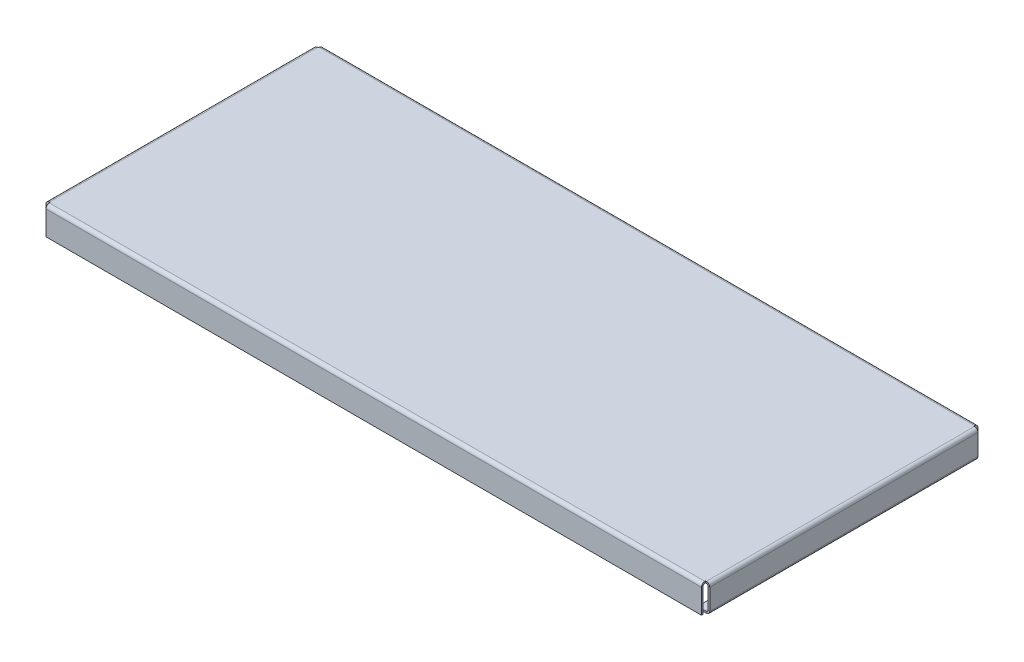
ISO-10303-21;
HEADER;
FILE_DESCRIPTION(('STEP AP214'),'2;1');
FILE_NAME('part.step','',(''),(''),'','','');
FILE_SCHEMA(('AUTOMOTIVE_DESIGN { 1 0 10303 214 1 1 1 1 }'));
ENDSEC;
DATA;
#1=APPLICATION_CONTEXT('core data for automotive mechanical design processes');
#2=APPLICATION_PROTOCOL_DEFINITION('international standard','automotive_design',2000,#1);
#3=PRODUCT_CONTEXT('',#1,'mechanical');
#4=PRODUCT('Part','Part','',(#3));
#5=PRODUCT_RELATED_PRODUCT_CATEGORY('part','',(#4));
#6=PRODUCT_DEFINITION_FORMATION('','',#4);
#7=PRODUCT_DEFINITION_CONTEXT('part definition',#1,'design');
#8=PRODUCT_DEFINITION('design','',#6,#7);
#9=PRODUCT_DEFINITION_SHAPE('','',#8);
#10=(LENGTH_UNIT() NAMED_UNIT(*) SI_UNIT(.MILLI.,.METRE.));
#11=(NAMED_UNIT(*) PLANE_ANGLE_UNIT() SI_UNIT($,.RADIAN.));
#12=(NAMED_UNIT(*) SI_UNIT($,.STERADIAN.) SOLID_ANGLE_UNIT());
#13=UNCERTAINTY_MEASURE_WITH_UNIT(LENGTH_MEASURE(1.E-05),#10,'distance_accuracy_value','');
#14=(GEOMETRIC_REPRESENTATION_CONTEXT(3) GLOBAL_UNCERTAINTY_ASSIGNED_CONTEXT((#13)) GLOBAL_UNIT_ASSIGNED_CONTEXT((#10,
#11,#12)) REPRESENTATION_CONTEXT('',''));
#15=CARTESIAN_POINT('',(0.,0.,0.));
#16=DIRECTION('',(0.,0.,1.));
#17=DIRECTION('',(1.,0.,0.));
#18=AXIS2_PLACEMENT_3D('',#15,#16,#17);
#19=CARTESIAN_POINT('',(304.8,-25.4000000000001,0.));
#20=DIRECTION('',(1.,0.,0.));
#21=DIRECTION('',(0.,0.,-1.));
#22=AXIS2_PLACEMENT_3D('',#19,#20,#21);
#23=PLANE('',#22);
#24=DIRECTION('',(0.,1.,0.));
#25=VECTOR('',#24,1.);
#26=CARTESIAN_POINT('',(304.8,-40.48125,250.167435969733));
#27=LINE('',#26,#25);
#28=CARTESIAN_POINT('',(304.8,-22.2250000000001,250.167435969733));
#29=VERTEX_POINT('',#28);
#30=CARTESIAN_POINT('',(304.8,-3.17499999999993,250.167435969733));
#31=VERTEX_POINT('',#30);
#32=EDGE_CURVE('E718',#29,#31,#27,.T.);
#33=ORIENTED_EDGE('',*,*,#32,.F.);
#34=DIRECTION('',(0.,0.,1.));
#35=VECTOR('',#34,1.);
#36=CARTESIAN_POINT('',(304.8,-22.2250000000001,250.167435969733));
#37=LINE('',#36,#35);
#38=CARTESIAN_POINT('',(304.8,-22.2250000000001,3.83256403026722));
#39=VERTEX_POINT('',#38);
#40=EDGE_CURVE('E374',#29,#39,#37,.F.);
#41=ORIENTED_EDGE('',*,*,#40,.T.);
#42=DIRECTION('',(0.,1.,0.));
#43=VECTOR('',#42,1.);
#44=CARTESIAN_POINT('',(304.8,-40.48125,3.83256403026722));
#45=LINE('',#44,#43);
#46=CARTESIAN_POINT('',(304.8,-3.17500000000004,3.83256403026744));
#47=VERTEX_POINT('',#46);
#48=EDGE_CURVE('E721',#39,#47,#45,.T.);
#49=ORIENTED_EDGE('',*,*,#48,.T.);
#50=DIRECTION('',(0.,0.,-1.));
#51=VECTOR('',#50,1.);
#52=CARTESIAN_POINT('',(304.8,-3.17500000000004,3.83256403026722));
#53=LINE('',#52,#51);
#54=EDGE_CURVE('E731',#31,#47,#53,.T.);
#55=ORIENTED_EDGE('',*,*,#54,.F.);
#56=EDGE_LOOP('',(#33,#41,#49,#55));
#57=FACE_BOUND('',#56,.T.);
#58=ADVANCED_FACE('F84',(#57),#23,.T.);
#59=CARTESIAN_POINT('',(-189.870879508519,-25.4000000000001,250.167435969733));
#60=DIRECTION('',(0.,0.,1.));
#61=DIRECTION('',(0.,-1.,0.));
#62=AXIS2_PLACEMENT_3D('',#59,#60,#61);
#63=PLANE('',#62);
#64=DIRECTION('',(0.,1.,0.));
#65=VECTOR('',#64,1.);
#66=CARTESIAN_POINT('',(303.2125,-25.4000000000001,250.167435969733));
#67=LINE('',#66,#65);
#68=CARTESIAN_POINT('',(303.2125,-22.2250000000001,250.167435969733));
#69=VERTEX_POINT('',#68);
#70=CARTESIAN_POINT('',(303.2125,-3.17499999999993,250.167435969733));
#71=VERTEX_POINT('',#70);
#72=EDGE_CURVE('E715',#69,#71,#67,.T.);
#73=ORIENTED_EDGE('',*,*,#72,.F.);
#74=DIRECTION('',(1.,0.,0.));
#75=VECTOR('',#74,1.);
#76=CARTESIAN_POINT('',(303.2125,-22.2250000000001,250.167435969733));
#77=LINE('',#76,#75);
#78=EDGE_CURVE('E381',#69,#29,#77,.T.);
#79=ORIENTED_EDGE('',*,*,#78,.T.);
#80=ORIENTED_EDGE('',*,*,#32,.T.);
#81=DIRECTION('',(1.,0.,0.));
#82=VECTOR('',#81,1.);
#83=CARTESIAN_POINT('',(-189.870879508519,-3.17500000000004,250.167435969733));
#84=LINE('',#83,#82);
#85=EDGE_CURVE('E670',#71,#31,#84,.T.);
#86=ORIENTED_EDGE('',*,*,#85,.F.);
#87=EDGE_LOOP('',(#73,#79,#80,#86));
#88=FACE_BOUND('',#87,.T.);
#89=ADVANCED_FACE('F878',(#88),#63,.T.);
#90=CARTESIAN_POINT('',(303.2125,-25.4000000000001,0.));
#91=DIRECTION('',(1.,0.,0.));
#92=DIRECTION('',(0.,0.,-1.));
#93=AXIS2_PLACEMENT_3D('',#90,#91,#92);
#94=PLANE('',#93);
#95=DIRECTION('',(0.,0.,1.));
#96=VECTOR('',#95,1.);
#97=CARTESIAN_POINT('',(303.2125,-22.2250000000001,250.167435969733));
#98=LINE('',#97,#96);
#99=CARTESIAN_POINT('',(303.2125,-22.2250000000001,3.83256403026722));
#100=VERTEX_POINT('',#99);
#101=EDGE_CURVE('E389',#69,#100,#98,.F.);
#102=ORIENTED_EDGE('',*,*,#101,.F.);
#103=ORIENTED_EDGE('',*,*,#72,.T.);
#104=DIRECTION('',(0.,0.,-1.));
#105=VECTOR('',#104,1.);
#106=CARTESIAN_POINT('',(303.2125,-3.17500000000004,3.83256403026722));
#107=LINE('',#106,#105);
#108=CARTESIAN_POINT('',(303.2125,-3.17500000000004,3.83256403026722));
#109=VERTEX_POINT('',#108);
#110=EDGE_CURVE('E710',#71,#109,#107,.T.);
#111=ORIENTED_EDGE('',*,*,#110,.T.);
#112=DIRECTION('',(0.,1.,0.));
#113=VECTOR('',#112,1.);
#114=CARTESIAN_POINT('',(303.2125,-25.4000000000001,3.83256403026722));
#115=LINE('',#114,#113);
#116=EDGE_CURVE('E724',#100,#109,#115,.T.);
#117=ORIENTED_EDGE('',*,*,#116,.F.);
#118=EDGE_LOOP('',(#102,#103,#111,#117));
#119=FACE_BOUND('',#118,.T.);
#120=ADVANCED_FACE('F884',(#119),#94,.F.);
#121=CARTESIAN_POINT('',(-304.8,-25.4000000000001,0.));
#122=DIRECTION('',(-1.,0.,0.));
#123=DIRECTION('',(0.,0.,1.));
#124=AXIS2_PLACEMENT_3D('',#121,#122,#123);
#125=PLANE('',#124);
#126=DIRECTION('',(0.,1.,0.));
#127=VECTOR('',#126,1.);
#128=CARTESIAN_POINT('',(-304.8,-40.48125,3.83256403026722));
#129=LINE('',#128,#127);
#130=CARTESIAN_POINT('',(-304.8,-22.2250000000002,3.83256403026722));
#131=VERTEX_POINT('',#130);
#132=CARTESIAN_POINT('',(-304.8,-3.17500000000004,3.83256403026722));
#133=VERTEX_POINT('',#132);
#134=EDGE_CURVE('E783',#131,#133,#129,.T.);
#135=ORIENTED_EDGE('',*,*,#134,.F.);
#136=DIRECTION('',(0.,0.,-1.));
#137=VECTOR('',#136,1.);
#138=CARTESIAN_POINT('',(-304.8,-22.2250000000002,3.83256403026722));
#139=LINE('',#138,#137);
#140=CARTESIAN_POINT('',(-304.8,-22.2250000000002,250.167435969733));
#141=VERTEX_POINT('',#140);
#142=EDGE_CURVE('E445',#131,#141,#139,.F.);
#143=ORIENTED_EDGE('',*,*,#142,.T.);
#144=DIRECTION('',(0.,1.,0.));
#145=VECTOR('',#144,1.);
#146=CARTESIAN_POINT('',(-304.8,-40.48125,250.167435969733));
#147=LINE('',#146,#145);
#148=CARTESIAN_POINT('',(-304.8,-3.17500000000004,250.167435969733));
#149=VERTEX_POINT('',#148);
#150=EDGE_CURVE('E786',#141,#149,#147,.T.);
#151=ORIENTED_EDGE('',*,*,#150,.T.);
#152=DIRECTION('',(0.,0.,1.));
#153=VECTOR('',#152,1.);
#154=CARTESIAN_POINT('',(-304.8,-3.17500000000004,250.167435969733));
#155=LINE('',#154,#153);
#156=EDGE_CURVE('E795',#133,#149,#155,.T.);
#157=ORIENTED_EDGE('',*,*,#156,.F.);
#158=EDGE_LOOP('',(#135,#143,#151,#157));
#159=FACE_BOUND('',#158,.T.);
#160=ADVANCED_FACE('F892',(#159),#125,.T.);
#161=CARTESIAN_POINT('',(189.870879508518,-25.4000000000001,3.83256403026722));
#162=DIRECTION('',(0.,0.,-1.));
#163=DIRECTION('',(0.,-1.,0.));
#164=AXIS2_PLACEMENT_3D('',#161,#162,#163);
#165=PLANE('',#164);
#166=DIRECTION('',(0.,1.,0.));
#167=VECTOR('',#166,1.);
#168=CARTESIAN_POINT('',(-303.2125,-25.4000000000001,3.83256403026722));
#169=LINE('',#168,#167);
#170=CARTESIAN_POINT('',(-303.2125,-22.2250000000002,3.83256403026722));
#171=VERTEX_POINT('',#170);
#172=CARTESIAN_POINT('',(-303.2125,-3.17500000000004,3.83256403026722));
#173=VERTEX_POINT('',#172);
#174=EDGE_CURVE('E94',#171,#173,#169,.T.);
#175=ORIENTED_EDGE('',*,*,#174,.F.);
#176=DIRECTION('',(-1.,0.,0.));
#177=VECTOR('',#176,1.);
#178=CARTESIAN_POINT('',(-303.2125,-22.2250000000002,3.83256403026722));
#179=LINE('',#178,#177);
#180=EDGE_CURVE('E452',#171,#131,#179,.T.);
#181=ORIENTED_EDGE('',*,*,#180,.T.);
#182=ORIENTED_EDGE('',*,*,#134,.T.);
#183=DIRECTION('',(-1.,0.,0.));
#184=VECTOR('',#183,1.);
#185=CARTESIAN_POINT('',(189.870879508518,-3.17500000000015,3.83256403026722));
#186=LINE('',#185,#184);
#187=EDGE_CURVE('E88',#173,#133,#186,.T.);
#188=ORIENTED_EDGE('',*,*,#187,.F.);
#189=EDGE_LOOP('',(#175,#181,#182,#188));
#190=FACE_BOUND('',#189,.T.);
#191=ADVANCED_FACE('F897',(#190),#165,.T.);
#192=CARTESIAN_POINT('',(-303.2125,-25.4000000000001,0.));
#193=DIRECTION('',(-1.,0.,0.));
#194=DIRECTION('',(0.,0.,1.));
#195=AXIS2_PLACEMENT_3D('',#192,#193,#194);
#196=PLANE('',#195);
#197=DIRECTION('',(0.,0.,-1.));
#198=VECTOR('',#197,1.);
#199=CARTESIAN_POINT('',(-303.2125,-22.2250000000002,3.83256403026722));
#200=LINE('',#199,#198);
#201=CARTESIAN_POINT('',(-303.2125,-22.2250000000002,250.167435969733));
#202=VERTEX_POINT('',#201);
#203=EDGE_CURVE('E460',#171,#202,#200,.F.);
#204=ORIENTED_EDGE('',*,*,#203,.F.);
#205=ORIENTED_EDGE('',*,*,#174,.T.);
#206=DIRECTION('',(0.,0.,1.));
#207=VECTOR('',#206,1.);
#208=CARTESIAN_POINT('',(-303.2125,-3.17500000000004,250.167435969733));
#209=LINE('',#208,#207);
#210=CARTESIAN_POINT('',(-303.2125,-3.17500000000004,250.167435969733));
#211=VERTEX_POINT('',#210);
#212=EDGE_CURVE('E13',#173,#211,#209,.T.);
#213=ORIENTED_EDGE('',*,*,#212,.T.);
#214=DIRECTION('',(0.,1.,0.));
#215=VECTOR('',#214,1.);
#216=CARTESIAN_POINT('',(-303.2125,-25.4000000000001,250.167435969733));
#217=LINE('',#216,#215);
#218=EDGE_CURVE('E789',#202,#211,#217,.T.);
#219=ORIENTED_EDGE('',*,*,#218,.F.);
#220=EDGE_LOOP('',(#204,#205,#213,#219));
#221=FACE_BOUND('',#220,.T.);
#222=ADVANCED_FACE('F86',(#221),#196,.F.);
#223=CARTESIAN_POINT('',(189.870879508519,-25.4000000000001,250.167435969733));
#224=DIRECTION('',(0.,0.,1.));
#225=DIRECTION('',(0.,1.,0.));
#226=AXIS2_PLACEMENT_3D('',#223,#224,#225);
#227=PLANE('',#226);
#228=DIRECTION('',(-1.,0.,0.));
#229=VECTOR('',#228,1.);
#230=CARTESIAN_POINT('',(-303.2125,-22.2250000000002,250.167435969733));
#231=LINE('',#230,#229);
#232=EDGE_CURVE('E466',#202,#141,#231,.T.);
#233=ORIENTED_EDGE('',*,*,#232,.F.);
#234=ORIENTED_EDGE('',*,*,#218,.T.);
#235=DIRECTION('',(-1.,0.,0.));
#236=VECTOR('',#235,1.);
#237=CARTESIAN_POINT('',(189.870879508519,-3.17500000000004,250.167435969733));
#238=LINE('',#237,#236);
#239=EDGE_CURVE('E792',#211,#149,#238,.T.);
#240=ORIENTED_EDGE('',*,*,#239,.T.);
#241=ORIENTED_EDGE('',*,*,#150,.F.);
#242=EDGE_LOOP('',(#233,#234,#240,#241));
#243=FACE_BOUND('',#242,.T.);
#244=ADVANCED_FACE('F867',(#243),#227,.T.);
#245=CARTESIAN_POINT('',(0.,-25.4,-950.690069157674));
#246=DIRECTION('',(0.,-1.,0.));
#247=DIRECTION('',(0.,0.,-1.));
#248=AXIS2_PLACEMENT_3D('',#245,#246,#247);
#249=PLANE('',#248);
#250=DIRECTION('',(0.,0.,1.));
#251=VECTOR('',#250,1.);
#252=CARTESIAN_POINT('',(300.967435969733,-25.4,-950.690069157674));
#253=LINE('',#252,#251);
#254=CARTESIAN_POINT('',(300.967435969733,-25.4,252.4125));
#255=VERTEX_POINT('',#254);
#256=CARTESIAN_POINT('',(300.967435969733,-25.4000000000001,254.));
#257=VERTEX_POINT('',#256);
#258=EDGE_CURVE('E770',#255,#257,#253,.T.);
#259=ORIENTED_EDGE('',*,*,#258,.T.);
#260=DIRECTION('',(1.,0.,0.));
#261=VECTOR('',#260,1.);
#262=CARTESIAN_POINT('',(-304.8,-25.4000000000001,254.));
#263=LINE('',#262,#261);
#264=CARTESIAN_POINT('',(-300.967435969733,-25.4000000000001,254.));
#265=VERTEX_POINT('',#264);
#266=EDGE_CURVE('E758',#265,#257,#263,.T.);
#267=ORIENTED_EDGE('',*,*,#266,.F.);
#268=DIRECTION('',(0.,0.,1.));
#269=VECTOR('',#268,1.);
#270=CARTESIAN_POINT('',(-300.967435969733,-25.4,-950.690069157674));
#271=LINE('',#270,#269);
#272=CARTESIAN_POINT('',(-300.967435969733,-25.4,252.4125));
#273=VERTEX_POINT('',#272);
#274=EDGE_CURVE('E750',#273,#265,#271,.T.);
#275=ORIENTED_EDGE('',*,*,#274,.F.);
#276=DIRECTION('',(1.,0.,0.));
#277=VECTOR('',#276,1.);
#278=CARTESIAN_POINT('',(0.,-25.4000000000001,252.4125));
#279=LINE('',#278,#277);
#280=EDGE_CURVE('E767',#273,#255,#279,.T.);
#281=ORIENTED_EDGE('',*,*,#280,.T.);
#282=EDGE_LOOP('',(#259,#267,#275,#281));
#283=FACE_BOUND('',#282,.T.);
#284=ADVANCED_FACE('F865',(#283),#249,.T.);
#285=CARTESIAN_POINT('',(300.967435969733,-25.4,-950.690069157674));
#286=DIRECTION('',(1.,0.,0.));
#287=DIRECTION('',(0.,1.,0.));
#288=AXIS2_PLACEMENT_3D('',#285,#286,#287);
#289=PLANE('',#288);
#290=DIRECTION('',(0.,0.,1.));
#291=VECTOR('',#290,1.);
#292=CARTESIAN_POINT('',(300.967435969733,-3.17499999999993,-950.690069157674));
#293=LINE('',#292,#291);
#294=CARTESIAN_POINT('',(300.967435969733,-3.17499999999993,252.4125));
#295=VERTEX_POINT('',#294);
#296=CARTESIAN_POINT('',(300.967435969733,-3.17499999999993,254.));
#297=VERTEX_POINT('',#296);
#298=EDGE_CURVE('E764',#295,#297,#293,.T.);
#299=ORIENTED_EDGE('',*,*,#298,.T.);
#300=DIRECTION('',(0.,1.,0.));
#301=VECTOR('',#300,1.);
#302=CARTESIAN_POINT('',(300.967435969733,-40.48125,254.));
#303=LINE('',#302,#301);
#304=EDGE_CURVE('E754',#257,#297,#303,.T.);
#305=ORIENTED_EDGE('',*,*,#304,.F.);
#306=ORIENTED_EDGE('',*,*,#258,.F.);
#307=DIRECTION('',(0.,1.,0.));
#308=VECTOR('',#307,1.);
#309=CARTESIAN_POINT('',(300.967435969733,-25.4000000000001,252.4125));
#310=LINE('',#309,#308);
#311=EDGE_CURVE('E761',#255,#295,#310,.T.);
#312=ORIENTED_EDGE('',*,*,#311,.T.);
#313=EDGE_LOOP('',(#299,#305,#306,#312));
#314=FACE_BOUND('',#313,.T.);
#315=ADVANCED_FACE('F862',(#314),#289,.T.);
#316=CARTESIAN_POINT('',(-304.8,-25.4000000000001,254.));
#317=DIRECTION('',(0.,0.,1.));
#318=DIRECTION('',(1.,0.,0.));
#319=AXIS2_PLACEMENT_3D('',#316,#317,#318);
#320=PLANE('',#319);
#321=DIRECTION('',(1.,0.,0.));
#322=VECTOR('',#321,1.);
#323=CARTESIAN_POINT('',(300.967435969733,-3.17499999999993,254.));
#324=LINE('',#323,#322);
#325=CARTESIAN_POINT('',(-300.967435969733,-3.17499999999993,254.));
#326=VERTEX_POINT('',#325);
#327=EDGE_CURVE('E774',#326,#297,#324,.T.);
#328=ORIENTED_EDGE('',*,*,#327,.F.);
#329=DIRECTION('',(0.,1.,0.));
#330=VECTOR('',#329,1.);
#331=CARTESIAN_POINT('',(-300.967435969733,-40.48125,254.));
#332=LINE('',#331,#330);
#333=EDGE_CURVE('E746',#265,#326,#332,.T.);
#334=ORIENTED_EDGE('',*,*,#333,.F.);
#335=ORIENTED_EDGE('',*,*,#266,.T.);
#336=ORIENTED_EDGE('',*,*,#304,.T.);
#337=EDGE_LOOP('',(#328,#334,#335,#336));
#338=FACE_BOUND('',#337,.T.);
#339=ADVANCED_FACE('F845',(#338),#320,.T.);
#340=CARTESIAN_POINT('',(-300.967435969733,-25.4,-950.690069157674));
#341=DIRECTION('',(-1.,0.,0.));
#342=DIRECTION('',(0.,-1.,0.));
#343=AXIS2_PLACEMENT_3D('',#340,#341,#342);
#344=PLANE('',#343);
#345=ORIENTED_EDGE('',*,*,#274,.T.);
#346=ORIENTED_EDGE('',*,*,#333,.T.);
#347=DIRECTION('',(0.,0.,1.));
#348=VECTOR('',#347,1.);
#349=CARTESIAN_POINT('',(-300.967435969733,-3.17499999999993,-950.690069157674));
#350=LINE('',#349,#348);
#351=CARTESIAN_POINT('',(-300.967435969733,-3.17499999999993,252.4125));
#352=VERTEX_POINT('',#351);
#353=EDGE_CURVE('E714',#352,#326,#350,.T.);
#354=ORIENTED_EDGE('',*,*,#353,.F.);
#355=DIRECTION('',(0.,1.,0.));
#356=VECTOR('',#355,1.);
#357=CARTESIAN_POINT('',(-300.967435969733,-25.4,252.4125));
#358=LINE('',#357,#356);
#359=EDGE_CURVE('E742',#273,#352,#358,.T.);
#360=ORIENTED_EDGE('',*,*,#359,.F.);
#361=EDGE_LOOP('',(#345,#346,#354,#360));
#362=FACE_BOUND('',#361,.T.);
#363=ADVANCED_FACE('F849',(#362),#344,.T.);
#364=CARTESIAN_POINT('',(-304.8,-25.4000000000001,252.4125));
#365=DIRECTION('',(0.,0.,1.));
#366=DIRECTION('',(1.,0.,0.));
#367=AXIS2_PLACEMENT_3D('',#364,#365,#366);
#368=PLANE('',#367);
#369=ORIENTED_EDGE('',*,*,#359,.T.);
#370=DIRECTION('',(1.,0.,0.));
#371=VECTOR('',#370,1.);
#372=CARTESIAN_POINT('',(300.967435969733,-3.17499999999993,252.4125));
#373=LINE('',#372,#371);
#374=EDGE_CURVE('E738',#352,#295,#373,.T.);
#375=ORIENTED_EDGE('',*,*,#374,.T.);
#376=ORIENTED_EDGE('',*,*,#311,.F.);
#377=ORIENTED_EDGE('',*,*,#280,.F.);
#378=EDGE_LOOP('',(#369,#375,#376,#377));
#379=FACE_BOUND('',#378,.T.);
#380=ADVANCED_FACE('F859',(#379),#368,.F.);
#381=CARTESIAN_POINT('',(-189.870879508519,-25.4000000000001,3.83256403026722));
#382=DIRECTION('',(0.,0.,-1.));
#383=DIRECTION('',(0.,1.,0.));
#384=AXIS2_PLACEMENT_3D('',#381,#382,#383);
#385=PLANE('',#384);
#386=DIRECTION('',(1.,0.,0.));
#387=VECTOR('',#386,1.);
#388=CARTESIAN_POINT('',(303.2125,-22.2250000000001,3.83256403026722));
#389=LINE('',#388,#387);
#390=EDGE_CURVE('E396',#100,#39,#389,.T.);
#391=ORIENTED_EDGE('',*,*,#390,.F.);
#392=ORIENTED_EDGE('',*,*,#116,.T.);
#393=DIRECTION('',(1.,0.,0.));
#394=VECTOR('',#393,1.);
#395=CARTESIAN_POINT('',(-189.870879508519,-3.17500000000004,3.83256403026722));
#396=LINE('',#395,#394);
#397=EDGE_CURVE('E727',#109,#47,#396,.T.);
#398=ORIENTED_EDGE('',*,*,#397,.T.);
#399=ORIENTED_EDGE('',*,*,#48,.F.);
#400=EDGE_LOOP('',(#391,#392,#398,#399));
#401=FACE_BOUND('',#400,.T.);
#402=ADVANCED_FACE('F889',(#401),#385,.T.);
#403=CARTESIAN_POINT('',(0.,-25.4,1204.69006915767));
#404=DIRECTION('',(0.,-1.,0.));
#405=DIRECTION('',(0.,0.,-1.));
#406=AXIS2_PLACEMENT_3D('',#403,#404,#405);
#407=PLANE('',#406);
#408=DIRECTION('',(0.,0.,-1.));
#409=VECTOR('',#408,1.);
#410=CARTESIAN_POINT('',(-300.967435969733,-25.4,1204.69006915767));
#411=LINE('',#410,#409);
#412=CARTESIAN_POINT('',(-300.967435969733,-25.4,1.58750000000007));
#413=VERTEX_POINT('',#412);
#414=CARTESIAN_POINT('',(-300.967435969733,-25.4,0.));
#415=VERTEX_POINT('',#414);
#416=EDGE_CURVE('E699',#413,#415,#411,.T.);
#417=ORIENTED_EDGE('',*,*,#416,.T.);
#418=DIRECTION('',(-1.,0.,0.));
#419=VECTOR('',#418,1.);
#420=CARTESIAN_POINT('',(-304.8,-25.4,0.));
#421=LINE('',#420,#419);
#422=CARTESIAN_POINT('',(300.967435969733,-25.4,0.));
#423=VERTEX_POINT('',#422);
#424=EDGE_CURVE('E687',#423,#415,#421,.T.);
#425=ORIENTED_EDGE('',*,*,#424,.F.);
#426=DIRECTION('',(0.,0.,-1.));
#427=VECTOR('',#426,1.);
#428=CARTESIAN_POINT('',(300.967435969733,-25.4,1204.69006915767));
#429=LINE('',#428,#427);
#430=CARTESIAN_POINT('',(300.967435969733,-25.4,1.58750000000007));
#431=VERTEX_POINT('',#430);
#432=EDGE_CURVE('E679',#431,#423,#429,.T.);
#433=ORIENTED_EDGE('',*,*,#432,.F.);
#434=DIRECTION('',(-1.,0.,0.));
#435=VECTOR('',#434,1.);
#436=CARTESIAN_POINT('',(0.,-25.4,1.58750000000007));
#437=LINE('',#436,#435);
#438=EDGE_CURVE('E696',#431,#413,#437,.T.);
#439=ORIENTED_EDGE('',*,*,#438,.T.);
#440=EDGE_LOOP('',(#417,#425,#433,#439));
#441=FACE_BOUND('',#440,.T.);
#442=ADVANCED_FACE('F1183',(#441),#407,.T.);
#443=CARTESIAN_POINT('',(-300.967435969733,-25.4,1204.69006915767));
#444=DIRECTION('',(-1.,0.,0.));
#445=DIRECTION('',(0.,1.,0.));
#446=AXIS2_PLACEMENT_3D('',#443,#444,#445);
#447=PLANE('',#446);
#448=DIRECTION('',(0.,0.,-1.));
#449=VECTOR('',#448,1.);
#450=CARTESIAN_POINT('',(-300.967435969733,-3.17500000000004,1204.69006915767));
#451=LINE('',#450,#449);
#452=CARTESIAN_POINT('',(-300.967435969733,-3.17500000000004,1.58750000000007));
#453=VERTEX_POINT('',#452);
#454=CARTESIAN_POINT('',(-300.967435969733,-3.17500000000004,0.));
#455=VERTEX_POINT('',#454);
#456=EDGE_CURVE('E693',#453,#455,#451,.T.);
#457=ORIENTED_EDGE('',*,*,#456,.T.);
#458=DIRECTION('',(0.,1.,0.));
#459=VECTOR('',#458,1.);
#460=CARTESIAN_POINT('',(-300.967435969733,-40.48125,0.));
#461=LINE('',#460,#459);
#462=EDGE_CURVE('E683',#415,#455,#461,.T.);
#463=ORIENTED_EDGE('',*,*,#462,.F.);
#464=ORIENTED_EDGE('',*,*,#416,.F.);
#465=DIRECTION('',(0.,1.,0.));
#466=VECTOR('',#465,1.);
#467=CARTESIAN_POINT('',(-300.967435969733,-25.4,1.58750000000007));
#468=LINE('',#467,#466);
#469=EDGE_CURVE('E690',#413,#453,#468,.T.);
#470=ORIENTED_EDGE('',*,*,#469,.T.);
#471=EDGE_LOOP('',(#457,#463,#464,#470));
#472=FACE_BOUND('',#471,.T.);
#473=ADVANCED_FACE('F1186',(#472),#447,.T.);
#474=CARTESIAN_POINT('',(-304.8,-25.4,0.));
#475=DIRECTION('',(0.,0.,-1.));
#476=DIRECTION('',(-1.,0.,0.));
#477=AXIS2_PLACEMENT_3D('',#474,#475,#476);
#478=PLANE('',#477);
#479=DIRECTION('',(-1.,0.,0.));
#480=VECTOR('',#479,1.);
#481=CARTESIAN_POINT('',(-300.967435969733,-3.17500000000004,0.));
#482=LINE('',#481,#480);
#483=CARTESIAN_POINT('',(300.967435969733,-3.17500000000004,0.));
#484=VERTEX_POINT('',#483);
#485=EDGE_CURVE('E703',#484,#455,#482,.T.);
#486=ORIENTED_EDGE('',*,*,#485,.F.);
#487=DIRECTION('',(0.,1.,0.));
#488=VECTOR('',#487,1.);
#489=CARTESIAN_POINT('',(300.967435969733,-40.48125,0.));
#490=LINE('',#489,#488);
#491=EDGE_CURVE('E675',#423,#484,#490,.T.);
#492=ORIENTED_EDGE('',*,*,#491,.F.);
#493=ORIENTED_EDGE('',*,*,#424,.T.);
#494=ORIENTED_EDGE('',*,*,#462,.T.);
#495=EDGE_LOOP('',(#486,#492,#493,#494));
#496=FACE_BOUND('',#495,.T.);
#497=ADVANCED_FACE('F1190',(#496),#478,.T.);
#498=CARTESIAN_POINT('',(300.967435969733,-25.4,1204.69006915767));
#499=DIRECTION('',(1.,0.,0.));
#500=DIRECTION('',(0.,-1.,0.));
#501=AXIS2_PLACEMENT_3D('',#498,#499,#500);
#502=PLANE('',#501);
#503=ORIENTED_EDGE('',*,*,#432,.T.);
#504=ORIENTED_EDGE('',*,*,#491,.T.);
#505=DIRECTION('',(0.,0.,-1.));
#506=VECTOR('',#505,1.);
#507=CARTESIAN_POINT('',(300.967435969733,-3.17500000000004,1204.69006915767));
#508=LINE('',#507,#506);
#509=CARTESIAN_POINT('',(300.967435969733,-3.17500000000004,1.58750000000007));
#510=VERTEX_POINT('',#509);
#511=EDGE_CURVE('E665',#510,#484,#508,.T.);
#512=ORIENTED_EDGE('',*,*,#511,.F.);
#513=DIRECTION('',(0.,1.,0.));
#514=VECTOR('',#513,1.);
#515=CARTESIAN_POINT('',(300.967435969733,-25.4,1.58750000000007));
#516=LINE('',#515,#514);
#517=EDGE_CURVE('E671',#431,#510,#516,.T.);
#518=ORIENTED_EDGE('',*,*,#517,.F.);
#519=EDGE_LOOP('',(#503,#504,#512,#518));
#520=FACE_BOUND('',#519,.T.);
#521=ADVANCED_FACE('F1194',(#520),#502,.T.);
#522=CARTESIAN_POINT('',(-304.8,-25.4,1.58750000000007));
#523=DIRECTION('',(0.,0.,-1.));
#524=DIRECTION('',(-1.,0.,0.));
#525=AXIS2_PLACEMENT_3D('',#522,#523,#524);
#526=PLANE('',#525);
#527=ORIENTED_EDGE('',*,*,#517,.T.);
#528=DIRECTION('',(-1.,0.,0.));
#529=VECTOR('',#528,1.);
#530=CARTESIAN_POINT('',(-300.967435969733,-3.17500000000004,1.58750000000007));
#531=LINE('',#530,#529);
#532=EDGE_CURVE('E666',#510,#453,#531,.T.);
#533=ORIENTED_EDGE('',*,*,#532,.T.);
#534=ORIENTED_EDGE('',*,*,#469,.F.);
#535=ORIENTED_EDGE('',*,*,#438,.F.);
#536=EDGE_LOOP('',(#527,#533,#534,#535));
#537=FACE_BOUND('',#536,.T.);
#538=ADVANCED_FACE('F1182',(#537),#526,.F.);
#539=CARTESIAN_POINT('',(0.,-1304.21023611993,250.167435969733));
#540=DIRECTION('',(0.,0.,1.));
#541=DIRECTION('',(1.,0.,0.));
#542=AXIS2_PLACEMENT_3D('',#539,#540,#541);
#543=PLANE('',#542);
#544=DIRECTION('',(0.,1.,0.));
#545=VECTOR('',#544,1.);
#546=CARTESIAN_POINT('',(-300.967435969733,-1304.21023611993,250.167435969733));
#547=LINE('',#546,#545);
#548=CARTESIAN_POINT('',(-300.967435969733,-1.58749999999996,250.167435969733));
#549=VERTEX_POINT('',#548);
#550=CARTESIAN_POINT('',(-300.967435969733,0.,250.167435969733));
#551=VERTEX_POINT('',#550);
#552=EDGE_CURVE('E617',#549,#551,#547,.T.);
#553=ORIENTED_EDGE('',*,*,#552,.T.);
#554=DIRECTION('',(1.,0.,0.));
#555=VECTOR('',#554,1.);
#556=CARTESIAN_POINT('',(-304.8,0.,250.167435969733));
#557=LINE('',#556,#555);
#558=CARTESIAN_POINT('',(-301.625,0.,250.167435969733));
#559=VERTEX_POINT('',#558);
#560=EDGE_CURVE('E542',#559,#551,#557,.T.);
#561=ORIENTED_EDGE('',*,*,#560,.F.);
#562=DIRECTION('',(0.,1.,0.));
#563=VECTOR('',#562,1.);
#564=CARTESIAN_POINT('',(-301.625,-1304.21023611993,250.167435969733));
#565=LINE('',#564,#563);
#566=CARTESIAN_POINT('',(-301.625,-1.58749999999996,250.167435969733));
#567=VERTEX_POINT('',#566);
#568=EDGE_CURVE('E661',#567,#559,#565,.T.);
#569=ORIENTED_EDGE('',*,*,#568,.F.);
#570=DIRECTION('',(1.,0.,0.));
#571=VECTOR('',#570,1.);
#572=CARTESIAN_POINT('',(0.,-1.58749999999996,250.167435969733));
#573=LINE('',#572,#571);
#574=EDGE_CURVE('E594',#567,#549,#573,.T.);
#575=ORIENTED_EDGE('',*,*,#574,.T.);
#576=EDGE_LOOP('',(#553,#561,#569,#575));
#577=FACE_BOUND('',#576,.T.);
#578=ADVANCED_FACE('F826',(#577),#543,.T.);
#579=CARTESIAN_POINT('',(0.,-1304.21023611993,3.83256403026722));
#580=DIRECTION('',(0.,0.,-1.));
#581=DIRECTION('',(-1.,0.,0.));
#582=AXIS2_PLACEMENT_3D('',#579,#580,#581);
#583=PLANE('',#582);
#584=DIRECTION('',(0.,1.,0.));
#585=VECTOR('',#584,1.);
#586=CARTESIAN_POINT('',(-301.625,-1304.21023611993,3.83256403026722));
#587=LINE('',#586,#585);
#588=CARTESIAN_POINT('',(-301.625,-1.58750000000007,3.83256403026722));
#589=VERTEX_POINT('',#588);
#590=CARTESIAN_POINT('',(-301.625,0.,3.83256403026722));
#591=VERTEX_POINT('',#590);
#592=EDGE_CURVE('E657',#589,#591,#587,.T.);
#593=ORIENTED_EDGE('',*,*,#592,.T.);
#594=DIRECTION('',(-1.,0.,0.));
#595=VECTOR('',#594,1.);
#596=CARTESIAN_POINT('',(-300.967435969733,0.,3.83256403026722));
#597=LINE('',#596,#595);
#598=CARTESIAN_POINT('',(-300.967435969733,0.,3.83256403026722));
#599=VERTEX_POINT('',#598);
#600=EDGE_CURVE('E539',#599,#591,#597,.T.);
#601=ORIENTED_EDGE('',*,*,#600,.F.);
#602=DIRECTION('',(0.,1.,0.));
#603=VECTOR('',#602,1.);
#604=CARTESIAN_POINT('',(-300.967435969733,-1304.21023611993,3.83256403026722));
#605=LINE('',#604,#603);
#606=CARTESIAN_POINT('',(-300.967435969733,-1.58750000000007,3.83256403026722));
#607=VERTEX_POINT('',#606);
#608=EDGE_CURVE('E653',#607,#599,#605,.T.);
#609=ORIENTED_EDGE('',*,*,#608,.F.);
#610=DIRECTION('',(-1.,0.,0.));
#611=VECTOR('',#610,1.);
#612=CARTESIAN_POINT('',(0.,-1.58749999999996,3.83256403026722));
#613=LINE('',#612,#611);
#614=EDGE_CURVE('E598',#607,#589,#613,.T.);
#615=ORIENTED_EDGE('',*,*,#614,.T.);
#616=EDGE_LOOP('',(#593,#601,#609,#615));
#617=FACE_BOUND('',#616,.T.);
#618=ADVANCED_FACE('F1175',(#617),#583,.T.);
#619=CARTESIAN_POINT('',(-300.967435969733,-1304.21023611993,0.));
#620=DIRECTION('',(-1.,0.,0.));
#621=DIRECTION('',(0.,0.,1.));
#622=AXIS2_PLACEMENT_3D('',#619,#620,#621);
#623=PLANE('',#622);
#624=ORIENTED_EDGE('',*,*,#608,.T.);
#625=DIRECTION('',(0.,0.,1.));
#626=VECTOR('',#625,1.);
#627=CARTESIAN_POINT('',(-300.967435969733,0.,0.));
#628=LINE('',#627,#626);
#629=CARTESIAN_POINT('',(-300.967435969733,0.,3.17499999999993));
#630=VERTEX_POINT('',#629);
#631=EDGE_CURVE('E530',#630,#599,#628,.T.);
#632=ORIENTED_EDGE('',*,*,#631,.F.);
#633=DIRECTION('',(0.,1.,0.));
#634=VECTOR('',#633,1.);
#635=CARTESIAN_POINT('',(-300.967435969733,-1304.21023611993,3.17499999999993));
#636=LINE('',#635,#634);
#637=CARTESIAN_POINT('',(-300.967435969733,-1.58749999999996,3.17499999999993));
#638=VERTEX_POINT('',#637);
#639=EDGE_CURVE('E649',#638,#630,#636,.T.);
#640=ORIENTED_EDGE('',*,*,#639,.F.);
#641=DIRECTION('',(0.,0.,1.));
#642=VECTOR('',#641,1.);
#643=CARTESIAN_POINT('',(-300.967435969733,-1.58749999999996,0.));
#644=LINE('',#643,#642);
#645=EDGE_CURVE('E576',#638,#607,#644,.T.);
#646=ORIENTED_EDGE('',*,*,#645,.T.);
#647=EDGE_LOOP('',(#624,#632,#640,#646));
#648=FACE_BOUND('',#647,.T.);
#649=ADVANCED_FACE('F1171',(#648),#623,.T.);
#650=CARTESIAN_POINT('',(300.967435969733,-1304.21023611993,0.));
#651=DIRECTION('',(1.,0.,0.));
#652=DIRECTION('',(0.,0.,-1.));
#653=AXIS2_PLACEMENT_3D('',#650,#651,#652);
#654=PLANE('',#653);
#655=DIRECTION('',(0.,1.,0.));
#656=VECTOR('',#655,1.);
#657=CARTESIAN_POINT('',(300.967435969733,-1304.21023611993,3.17499999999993));
#658=LINE('',#657,#656);
#659=CARTESIAN_POINT('',(300.967435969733,-1.58750000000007,3.17499999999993));
#660=VERTEX_POINT('',#659);
#661=CARTESIAN_POINT('',(300.967435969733,0.,3.17499999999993));
#662=VERTEX_POINT('',#661);
#663=EDGE_CURVE('E645',#660,#662,#658,.T.);
#664=ORIENTED_EDGE('',*,*,#663,.T.);
#665=DIRECTION('',(0.,0.,-1.));
#666=VECTOR('',#665,1.);
#667=CARTESIAN_POINT('',(300.967435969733,0.,3.83256403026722));
#668=LINE('',#667,#666);
#669=CARTESIAN_POINT('',(300.967435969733,0.,3.83256403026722));
#670=VERTEX_POINT('',#669);
#671=EDGE_CURVE('E557',#670,#662,#668,.T.);
#672=ORIENTED_EDGE('',*,*,#671,.F.);
#673=DIRECTION('',(0.,1.,0.));
#674=VECTOR('',#673,1.);
#675=CARTESIAN_POINT('',(300.967435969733,-1304.21023611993,3.83256403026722));
#676=LINE('',#675,#674);
#677=CARTESIAN_POINT('',(300.967435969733,-1.58750000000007,3.83256403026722));
#678=VERTEX_POINT('',#677);
#679=EDGE_CURVE('E641',#678,#670,#676,.T.);
#680=ORIENTED_EDGE('',*,*,#679,.F.);
#681=DIRECTION('',(0.,0.,-1.));
#682=VECTOR('',#681,1.);
#683=CARTESIAN_POINT('',(300.967435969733,-1.58749999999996,0.));
#684=LINE('',#683,#682);
#685=EDGE_CURVE('E579',#678,#660,#684,.T.);
#686=ORIENTED_EDGE('',*,*,#685,.T.);
#687=EDGE_LOOP('',(#664,#672,#680,#686));
#688=FACE_BOUND('',#687,.T.);
#689=ADVANCED_FACE('F1168',(#688),#654,.T.);
#690=CARTESIAN_POINT('',(0.,-1304.21023611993,3.83256403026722));
#691=DIRECTION('',(0.,0.,-1.));
#692=DIRECTION('',(-1.,0.,0.));
#693=AXIS2_PLACEMENT_3D('',#690,#691,#692);
#694=PLANE('',#693);
#695=ORIENTED_EDGE('',*,*,#679,.T.);
#696=DIRECTION('',(-1.,0.,0.));
#697=VECTOR('',#696,1.);
#698=CARTESIAN_POINT('',(304.8,0.,3.83256403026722));
#699=LINE('',#698,#697);
#700=CARTESIAN_POINT('',(301.625,0.,3.83256403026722));
#701=VERTEX_POINT('',#700);
#702=EDGE_CURVE('E554',#701,#670,#699,.T.);
#703=ORIENTED_EDGE('',*,*,#702,.F.);
#704=DIRECTION('',(0.,1.,0.));
#705=VECTOR('',#704,1.);
#706=CARTESIAN_POINT('',(301.625,-1304.21023611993,3.83256403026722));
#707=LINE('',#706,#705);
#708=CARTESIAN_POINT('',(301.625,-1.58749999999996,3.83256403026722));
#709=VERTEX_POINT('',#708);
#710=EDGE_CURVE('E637',#709,#701,#707,.T.);
#711=ORIENTED_EDGE('',*,*,#710,.F.);
#712=DIRECTION('',(-1.,0.,0.));
#713=VECTOR('',#712,1.);
#714=CARTESIAN_POINT('',(0.,-1.58749999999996,3.83256403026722));
#715=LINE('',#714,#713);
#716=EDGE_CURVE('E582',#709,#678,#715,.T.);
#717=ORIENTED_EDGE('',*,*,#716,.T.);
#718=EDGE_LOOP('',(#695,#703,#711,#717));
#719=FACE_BOUND('',#718,.T.);
#720=ADVANCED_FACE('F932',(#719),#694,.T.);
#721=CARTESIAN_POINT('',(0.,-1304.21023611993,250.167435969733));
#722=DIRECTION('',(0.,0.,1.));
#723=DIRECTION('',(1.,0.,0.));
#724=AXIS2_PLACEMENT_3D('',#721,#722,#723);
#725=PLANE('',#724);
#726=DIRECTION('',(0.,1.,0.));
#727=VECTOR('',#726,1.);
#728=CARTESIAN_POINT('',(301.625,-1304.21023611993,250.167435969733));
#729=LINE('',#728,#727);
#730=CARTESIAN_POINT('',(301.625,-1.58750000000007,250.167435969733));
#731=VERTEX_POINT('',#730);
#732=CARTESIAN_POINT('',(301.625,0.,250.167435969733));
#733=VERTEX_POINT('',#732);
#734=EDGE_CURVE('E633',#731,#733,#729,.T.);
#735=ORIENTED_EDGE('',*,*,#734,.T.);
#736=DIRECTION('',(1.,0.,0.));
#737=VECTOR('',#736,1.);
#738=CARTESIAN_POINT('',(300.967435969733,0.,250.167435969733));
#739=LINE('',#738,#737);
#740=CARTESIAN_POINT('',(300.967435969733,0.,250.167435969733));
#741=VERTEX_POINT('',#740);
#742=EDGE_CURVE('E551',#741,#733,#739,.T.);
#743=ORIENTED_EDGE('',*,*,#742,.F.);
#744=DIRECTION('',(0.,1.,0.));
#745=VECTOR('',#744,1.);
#746=CARTESIAN_POINT('',(300.967435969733,-1304.21023611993,250.167435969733));
#747=LINE('',#746,#745);
#748=CARTESIAN_POINT('',(300.967435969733,-1.58750000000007,250.167435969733));
#749=VERTEX_POINT('',#748);
#750=EDGE_CURVE('E629',#749,#741,#747,.T.);
#751=ORIENTED_EDGE('',*,*,#750,.F.);
#752=DIRECTION('',(1.,0.,0.));
#753=VECTOR('',#752,1.);
#754=CARTESIAN_POINT('',(0.,-1.58749999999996,250.167435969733));
#755=LINE('',#754,#753);
#756=EDGE_CURVE('E585',#749,#731,#755,.T.);
#757=ORIENTED_EDGE('',*,*,#756,.T.);
#758=EDGE_LOOP('',(#735,#743,#751,#757));
#759=FACE_BOUND('',#758,.T.);
#760=ADVANCED_FACE('F920',(#759),#725,.T.);
#761=CARTESIAN_POINT('',(300.967435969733,-1304.21023611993,0.));
#762=DIRECTION('',(1.,0.,0.));
#763=DIRECTION('',(0.,0.,-1.));
#764=AXIS2_PLACEMENT_3D('',#761,#762,#763);
#765=PLANE('',#764);
#766=ORIENTED_EDGE('',*,*,#750,.T.);
#767=DIRECTION('',(0.,0.,-1.));
#768=VECTOR('',#767,1.);
#769=CARTESIAN_POINT('',(300.967435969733,0.,254.));
#770=LINE('',#769,#768);
#771=CARTESIAN_POINT('',(300.967435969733,0.,250.825));
#772=VERTEX_POINT('',#771);
#773=EDGE_CURVE('E548',#772,#741,#770,.T.);
#774=ORIENTED_EDGE('',*,*,#773,.F.);
#775=DIRECTION('',(0.,1.,0.));
#776=VECTOR('',#775,1.);
#777=CARTESIAN_POINT('',(300.967435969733,-1304.21023611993,250.825));
#778=LINE('',#777,#776);
#779=CARTESIAN_POINT('',(300.967435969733,-1.58749999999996,250.825));
#780=VERTEX_POINT('',#779);
#781=EDGE_CURVE('E625',#780,#772,#778,.T.);
#782=ORIENTED_EDGE('',*,*,#781,.F.);
#783=DIRECTION('',(0.,0.,-1.));
#784=VECTOR('',#783,1.);
#785=CARTESIAN_POINT('',(300.967435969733,-1.58749999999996,0.));
#786=LINE('',#785,#784);
#787=EDGE_CURVE('E588',#780,#749,#786,.T.);
#788=ORIENTED_EDGE('',*,*,#787,.T.);
#789=EDGE_LOOP('',(#766,#774,#782,#788));
#790=FACE_BOUND('',#789,.T.);
#791=ADVANCED_FACE('F1161',(#790),#765,.T.);
#792=CARTESIAN_POINT('',(-300.967435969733,-1304.21023611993,0.));
#793=DIRECTION('',(-1.,0.,0.));
#794=DIRECTION('',(0.,0.,1.));
#795=AXIS2_PLACEMENT_3D('',#792,#793,#794);
#796=PLANE('',#795);
#797=DIRECTION('',(0.,1.,0.));
#798=VECTOR('',#797,1.);
#799=CARTESIAN_POINT('',(-300.967435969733,-1304.21023611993,250.825));
#800=LINE('',#799,#798);
#801=CARTESIAN_POINT('',(-300.967435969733,-1.58750000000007,250.825));
#802=VERTEX_POINT('',#801);
#803=CARTESIAN_POINT('',(-300.967435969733,0.,250.825));
#804=VERTEX_POINT('',#803);
#805=EDGE_CURVE('E621',#802,#804,#800,.T.);
#806=ORIENTED_EDGE('',*,*,#805,.T.);
#807=DIRECTION('',(0.,0.,1.));
#808=VECTOR('',#807,1.);
#809=CARTESIAN_POINT('',(-300.967435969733,0.,250.167435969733));
#810=LINE('',#809,#808);
#811=EDGE_CURVE('E545',#551,#804,#810,.T.);
#812=ORIENTED_EDGE('',*,*,#811,.F.);
#813=ORIENTED_EDGE('',*,*,#552,.F.);
#814=DIRECTION('',(0.,0.,1.));
#815=VECTOR('',#814,1.);
#816=CARTESIAN_POINT('',(-300.967435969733,-1.58749999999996,0.));
#817=LINE('',#816,#815);
#818=EDGE_CURVE('E591',#549,#802,#817,.T.);
#819=ORIENTED_EDGE('',*,*,#818,.T.);
#820=EDGE_LOOP('',(#806,#812,#813,#819));
#821=FACE_BOUND('',#820,.T.);
#822=ADVANCED_FACE('F829',(#821),#796,.T.);
#823=CARTESIAN_POINT('',(0.,-1.58749999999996,0.));
#824=DIRECTION('',(0.,1.,0.));
#825=DIRECTION('',(0.,0.,1.));
#826=AXIS2_PLACEMENT_3D('',#823,#824,#825);
#827=PLANE('',#826);
#828=DIRECTION('',(0.,0.,1.));
#829=VECTOR('',#828,1.);
#830=CARTESIAN_POINT('',(-301.625,-1.58750000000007,250.167435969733));
#831=LINE('',#830,#829);
#832=EDGE_CURVE('E613',#589,#567,#831,.T.);
#833=ORIENTED_EDGE('',*,*,#832,.F.);
#834=ORIENTED_EDGE('',*,*,#614,.F.);
#835=ORIENTED_EDGE('',*,*,#645,.F.);
#836=DIRECTION('',(-1.,0.,0.));
#837=VECTOR('',#836,1.);
#838=CARTESIAN_POINT('',(-300.967435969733,-1.58750000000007,3.17499999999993));
#839=LINE('',#838,#837);
#840=EDGE_CURVE('E609',#660,#638,#839,.T.);
#841=ORIENTED_EDGE('',*,*,#840,.F.);
#842=ORIENTED_EDGE('',*,*,#685,.F.);
#843=ORIENTED_EDGE('',*,*,#716,.F.);
#844=DIRECTION('',(0.,0.,-1.));
#845=VECTOR('',#844,1.);
#846=CARTESIAN_POINT('',(301.625,-1.58750000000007,3.83256403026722));
#847=LINE('',#846,#845);
#848=EDGE_CURVE('E605',#731,#709,#847,.T.);
#849=ORIENTED_EDGE('',*,*,#848,.F.);
#850=ORIENTED_EDGE('',*,*,#756,.F.);
#851=ORIENTED_EDGE('',*,*,#787,.F.);
#852=DIRECTION('',(1.,0.,0.));
#853=VECTOR('',#852,1.);
#854=CARTESIAN_POINT('',(300.967435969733,-1.58750000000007,250.825));
#855=LINE('',#854,#853);
#856=EDGE_CURVE('E601',#802,#780,#855,.T.);
#857=ORIENTED_EDGE('',*,*,#856,.F.);
#858=ORIENTED_EDGE('',*,*,#818,.F.);
#859=ORIENTED_EDGE('',*,*,#574,.F.);
#860=EDGE_LOOP('',(#833,#834,#835,#841,#842,#843,#849,#850,#851,#857,#858,#859));
#861=FACE_BOUND('',#860,.T.);
#862=ADVANCED_FACE('F926',(#861),#827,.F.);
#863=CARTESIAN_POINT('',(0.,0.,0.));
#864=DIRECTION('',(0.,1.,0.));
#865=DIRECTION('',(0.,0.,1.));
#866=AXIS2_PLACEMENT_3D('',#863,#864,#865);
#867=PLANE('',#866);
#868=ORIENTED_EDGE('',*,*,#600,.T.);
#869=DIRECTION('',(0.,0.,1.));
#870=VECTOR('',#869,1.);
#871=CARTESIAN_POINT('',(-301.625,0.,250.167435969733));
#872=LINE('',#871,#870);
#873=EDGE_CURVE('E572',#591,#559,#872,.T.);
#874=ORIENTED_EDGE('',*,*,#873,.T.);
#875=ORIENTED_EDGE('',*,*,#560,.T.);
#876=ORIENTED_EDGE('',*,*,#811,.T.);
#877=DIRECTION('',(1.,0.,0.));
#878=VECTOR('',#877,1.);
#879=CARTESIAN_POINT('',(300.967435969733,0.,250.825));
#880=LINE('',#879,#878);
#881=EDGE_CURVE('E560',#804,#772,#880,.T.);
#882=ORIENTED_EDGE('',*,*,#881,.T.);
#883=ORIENTED_EDGE('',*,*,#773,.T.);
#884=ORIENTED_EDGE('',*,*,#742,.T.);
#885=DIRECTION('',(0.,0.,-1.));
#886=VECTOR('',#885,1.);
#887=CARTESIAN_POINT('',(301.625,0.,3.83256403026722));
#888=LINE('',#887,#886);
#889=EDGE_CURVE('E564',#733,#701,#888,.T.);
#890=ORIENTED_EDGE('',*,*,#889,.T.);
#891=ORIENTED_EDGE('',*,*,#702,.T.);
#892=ORIENTED_EDGE('',*,*,#671,.T.);
#893=DIRECTION('',(-1.,0.,0.));
#894=VECTOR('',#893,1.);
#895=CARTESIAN_POINT('',(-300.967435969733,0.,3.17499999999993));
#896=LINE('',#895,#894);
#897=EDGE_CURVE('E568',#662,#630,#896,.T.);
#898=ORIENTED_EDGE('',*,*,#897,.T.);
#899=ORIENTED_EDGE('',*,*,#631,.T.);
#900=EDGE_LOOP('',(#868,#874,#875,#876,#882,#883,#884,#890,#891,#892,#898,#899));
#901=FACE_BOUND('',#900,.T.);
#902=ADVANCED_FACE('F817',(#901),#867,.T.);
#903=CARTESIAN_POINT('',(-300.967435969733,-3.17500000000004,3.17499999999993));
#904=DIRECTION('',(-1.,0.,0.));
#905=DIRECTION('',(0.,-1.,0.));
#906=AXIS2_PLACEMENT_3D('',#903,#904,#905);
#907=PLANE('',#906);
#908=ORIENTED_EDGE('',*,*,#456,.F.);
#909=CARTESIAN_POINT('',(-300.967435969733,-3.17500000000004,3.17499999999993));
#910=DIRECTION('',(1.,0.,0.));
#911=DIRECTION('',(0.,0.,-1.));
#912=AXIS2_PLACEMENT_3D('',#909,#910,#911);
#913=CIRCLE('',#912,1.5875);
#914=EDGE_CURVE('E514',#453,#638,#913,.T.);
#915=ORIENTED_EDGE('',*,*,#914,.T.);
#916=ORIENTED_EDGE('',*,*,#639,.T.);
#917=CARTESIAN_POINT('',(-300.967435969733,-3.17500000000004,3.17499999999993));
#918=DIRECTION('',(1.,0.,0.));
#919=DIRECTION('',(0.,0.,-1.));
#920=AXIS2_PLACEMENT_3D('',#917,#918,#919);
#921=CIRCLE('',#920,3.175);
#922=EDGE_CURVE('E521',#455,#630,#921,.T.);
#923=ORIENTED_EDGE('',*,*,#922,.F.);
#924=EDGE_LOOP('',(#908,#915,#916,#923));
#925=FACE_BOUND('',#924,.T.);
#926=ADVANCED_FACE('F1148',(#925),#907,.T.);
#927=CARTESIAN_POINT('',(300.967435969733,-3.17500000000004,3.17499999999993));
#928=DIRECTION('',(1.,0.,0.));
#929=DIRECTION('',(0.,1.,0.));
#930=AXIS2_PLACEMENT_3D('',#927,#928,#929);
#931=PLANE('',#930);
#932=CARTESIAN_POINT('',(300.967435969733,-3.17500000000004,3.17499999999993));
#933=DIRECTION('',(1.,0.,0.));
#934=DIRECTION('',(0.,0.,-1.));
#935=AXIS2_PLACEMENT_3D('',#932,#933,#934);
#936=CIRCLE('',#935,1.5875);
#937=EDGE_CURVE('E526',#660,#510,#936,.F.);
#938=ORIENTED_EDGE('',*,*,#937,.T.);
#939=ORIENTED_EDGE('',*,*,#511,.T.);
#940=CARTESIAN_POINT('',(300.967435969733,-3.17500000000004,3.17499999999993));
#941=DIRECTION('',(1.,0.,0.));
#942=DIRECTION('',(0.,0.,-1.));
#943=AXIS2_PLACEMENT_3D('',#940,#941,#942);
#944=CIRCLE('',#943,3.175);
#945=EDGE_CURVE('E525',#662,#484,#944,.F.);
#946=ORIENTED_EDGE('',*,*,#945,.F.);
#947=ORIENTED_EDGE('',*,*,#663,.F.);
#948=EDGE_LOOP('',(#938,#939,#946,#947));
#949=FACE_BOUND('',#948,.T.);
#950=ADVANCED_FACE('F1143',(#949),#931,.T.);
#951=CARTESIAN_POINT('',(-1021.39319963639,-3.17500000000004,3.17499999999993));
#952=DIRECTION('',(1.,0.,0.));
#953=DIRECTION('',(0.,0.,-1.));
#954=AXIS2_PLACEMENT_3D('',#951,#952,#953);
#955=CYLINDRICAL_SURFACE('',#954,3.175);
#956=ORIENTED_EDGE('',*,*,#897,.F.);
#957=ORIENTED_EDGE('',*,*,#945,.T.);
#958=ORIENTED_EDGE('',*,*,#485,.T.);
#959=ORIENTED_EDGE('',*,*,#922,.T.);
#960=EDGE_LOOP('',(#956,#957,#958,#959));
#961=FACE_BOUND('',#960,.T.);
#962=ADVANCED_FACE('F1140',(#961),#955,.T.);
#963=CARTESIAN_POINT('',(-1021.39319963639,-3.17500000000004,3.17499999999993));
#964=DIRECTION('',(1.,0.,0.));
#965=DIRECTION('',(0.,0.,-1.));
#966=AXIS2_PLACEMENT_3D('',#963,#964,#965);
#967=CYLINDRICAL_SURFACE('',#966,1.5875);
#968=ORIENTED_EDGE('',*,*,#840,.T.);
#969=ORIENTED_EDGE('',*,*,#914,.F.);
#970=ORIENTED_EDGE('',*,*,#532,.F.);
#971=ORIENTED_EDGE('',*,*,#937,.F.);
#972=EDGE_LOOP('',(#968,#969,#970,#971));
#973=FACE_BOUND('',#972,.T.);
#974=ADVANCED_FACE('F1137',(#973),#967,.F.);
#975=CARTESIAN_POINT('',(301.625,-3.17500000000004,3.83256403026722));
#976=DIRECTION('',(0.,0.,-1.));
#977=DIRECTION('',(-1.,0.,0.));
#978=AXIS2_PLACEMENT_3D('',#975,#976,#977);
#979=PLANE('',#978);
#980=ORIENTED_EDGE('',*,*,#397,.F.);
#981=CARTESIAN_POINT('',(301.625,-3.17500000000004,3.83256403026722));
#982=DIRECTION('',(0.,0.,1.));
#983=DIRECTION('',(1.,0.,0.));
#984=AXIS2_PLACEMENT_3D('',#981,#982,#983);
#985=CIRCLE('',#984,1.5875);
#986=EDGE_CURVE('E498',#109,#709,#985,.T.);
#987=ORIENTED_EDGE('',*,*,#986,.T.);
#988=ORIENTED_EDGE('',*,*,#710,.T.);
#989=CARTESIAN_POINT('',(301.625,-3.17500000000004,3.83256403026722));
#990=DIRECTION('',(0.,0.,1.));
#991=DIRECTION('',(1.,0.,0.));
#992=AXIS2_PLACEMENT_3D('',#989,#990,#991);
#993=CIRCLE('',#992,3.175);
#994=EDGE_CURVE('E505',#47,#701,#993,.T.);
#995=ORIENTED_EDGE('',*,*,#994,.F.);
#996=EDGE_LOOP('',(#980,#987,#988,#995));
#997=FACE_BOUND('',#996,.T.);
#998=ADVANCED_FACE('F935',(#997),#979,.T.);
#999=CARTESIAN_POINT('',(301.625,-3.17500000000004,250.167435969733));
#1000=DIRECTION('',(0.,0.,1.));
#1001=DIRECTION('',(0.,-1.,0.));
#1002=AXIS2_PLACEMENT_3D('',#999,#1000,#1001);
#1003=PLANE('',#1002);
#1004=CARTESIAN_POINT('',(301.625,-3.17500000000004,250.167435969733));
#1005=DIRECTION('',(0.,0.,1.));
#1006=DIRECTION('',(1.,0.,0.));
#1007=AXIS2_PLACEMENT_3D('',#1004,#1005,#1006);
#1008=CIRCLE('',#1007,1.5875);
#1009=EDGE_CURVE('E510',#731,#71,#1008,.F.);
#1010=ORIENTED_EDGE('',*,*,#1009,.T.);
#1011=ORIENTED_EDGE('',*,*,#85,.T.);
#1012=CARTESIAN_POINT('',(301.625,-3.17500000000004,250.167435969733));
#1013=DIRECTION('',(0.,0.,1.));
#1014=DIRECTION('',(1.,0.,0.));
#1015=AXIS2_PLACEMENT_3D('',#1012,#1013,#1014);
#1016=CIRCLE('',#1015,3.175);
#1017=EDGE_CURVE('E509',#733,#31,#1016,.F.);
#1018=ORIENTED_EDGE('',*,*,#1017,.F.);
#1019=ORIENTED_EDGE('',*,*,#734,.F.);
#1020=EDGE_LOOP('',(#1010,#1011,#1018,#1019));
#1021=FACE_BOUND('',#1020,.T.);
#1022=ADVANCED_FACE('F917',(#1021),#1003,.T.);
#1023=CARTESIAN_POINT('',(301.625,-3.17500000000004,-707.869728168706));
#1024=DIRECTION('',(0.,0.,1.));
#1025=DIRECTION('',(1.,0.,0.));
#1026=AXIS2_PLACEMENT_3D('',#1023,#1024,#1025);
#1027=CYLINDRICAL_SURFACE('',#1026,3.175);
#1028=ORIENTED_EDGE('',*,*,#889,.F.);
#1029=ORIENTED_EDGE('',*,*,#1017,.T.);
#1030=ORIENTED_EDGE('',*,*,#54,.T.);
#1031=ORIENTED_EDGE('',*,*,#994,.T.);
#1032=EDGE_LOOP('',(#1028,#1029,#1030,#1031));
#1033=FACE_BOUND('',#1032,.T.);
#1034=ADVANCED_FACE('F939',(#1033),#1027,.T.);
#1035=CARTESIAN_POINT('',(301.625,-3.17500000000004,-707.869728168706));
#1036=DIRECTION('',(0.,0.,1.));
#1037=DIRECTION('',(1.,0.,0.));
#1038=AXIS2_PLACEMENT_3D('',#1035,#1036,#1037);
#1039=CYLINDRICAL_SURFACE('',#1038,1.5875);
#1040=ORIENTED_EDGE('',*,*,#848,.T.);
#1041=ORIENTED_EDGE('',*,*,#986,.F.);
#1042=ORIENTED_EDGE('',*,*,#110,.F.);
#1043=ORIENTED_EDGE('',*,*,#1009,.F.);
#1044=EDGE_LOOP('',(#1040,#1041,#1042,#1043));
#1045=FACE_BOUND('',#1044,.T.);
#1046=ADVANCED_FACE('F914',(#1045),#1039,.F.);
#1047=CARTESIAN_POINT('',(300.967435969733,-3.17500000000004,250.825));
#1048=DIRECTION('',(1.,0.,0.));
#1049=DIRECTION('',(0.,0.,-1.));
#1050=AXIS2_PLACEMENT_3D('',#1047,#1048,#1049);
#1051=PLANE('',#1050);
#1052=ORIENTED_EDGE('',*,*,#298,.F.);
#1053=CARTESIAN_POINT('',(300.967435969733,-3.17500000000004,250.825));
#1054=DIRECTION('',(-1.,0.,0.));
#1055=DIRECTION('',(0.,0.,1.));
#1056=AXIS2_PLACEMENT_3D('',#1053,#1054,#1055);
#1057=CIRCLE('',#1056,1.5875);
#1058=EDGE_CURVE('E482',#295,#780,#1057,.T.);
#1059=ORIENTED_EDGE('',*,*,#1058,.T.);
#1060=ORIENTED_EDGE('',*,*,#781,.T.);
#1061=CARTESIAN_POINT('',(300.967435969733,-3.17500000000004,250.825));
#1062=DIRECTION('',(-1.,0.,0.));
#1063=DIRECTION('',(0.,0.,1.));
#1064=AXIS2_PLACEMENT_3D('',#1061,#1062,#1063);
#1065=CIRCLE('',#1064,3.175);
#1066=EDGE_CURVE('E489',#297,#772,#1065,.T.);
#1067=ORIENTED_EDGE('',*,*,#1066,.F.);
#1068=EDGE_LOOP('',(#1052,#1059,#1060,#1067));
#1069=FACE_BOUND('',#1068,.T.);
#1070=ADVANCED_FACE('F840',(#1069),#1051,.T.);
#1071=CARTESIAN_POINT('',(-300.967435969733,-3.17500000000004,250.825));
#1072=DIRECTION('',(-1.,0.,0.));
#1073=DIRECTION('',(0.,0.,1.));
#1074=AXIS2_PLACEMENT_3D('',#1071,#1072,#1073);
#1075=PLANE('',#1074);
#1076=CARTESIAN_POINT('',(-300.967435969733,-3.17500000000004,250.825));
#1077=DIRECTION('',(-1.,0.,0.));
#1078=DIRECTION('',(0.,0.,1.));
#1079=AXIS2_PLACEMENT_3D('',#1076,#1077,#1078);
#1080=CIRCLE('',#1079,1.5875);
#1081=EDGE_CURVE('E494',#802,#352,#1080,.F.);
#1082=ORIENTED_EDGE('',*,*,#1081,.T.);
#1083=ORIENTED_EDGE('',*,*,#353,.T.);
#1084=CARTESIAN_POINT('',(-300.967435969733,-3.17500000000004,250.825));
#1085=DIRECTION('',(-1.,0.,0.));
#1086=DIRECTION('',(0.,0.,1.));
#1087=AXIS2_PLACEMENT_3D('',#1084,#1085,#1086);
#1088=CIRCLE('',#1087,3.175);
#1089=EDGE_CURVE('E493',#804,#326,#1088,.F.);
#1090=ORIENTED_EDGE('',*,*,#1089,.F.);
#1091=ORIENTED_EDGE('',*,*,#805,.F.);
#1092=EDGE_LOOP('',(#1082,#1083,#1090,#1091));
#1093=FACE_BOUND('',#1092,.T.);
#1094=ADVANCED_FACE('F852',(#1093),#1075,.T.);
#1095=CARTESIAN_POINT('',(991.746568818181,-3.17500000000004,250.825));
#1096=DIRECTION('',(-1.,0.,0.));
#1097=DIRECTION('',(0.,0.,1.));
#1098=AXIS2_PLACEMENT_3D('',#1095,#1096,#1097);
#1099=CYLINDRICAL_SURFACE('',#1098,3.175);
#1100=ORIENTED_EDGE('',*,*,#881,.F.);
#1101=ORIENTED_EDGE('',*,*,#1089,.T.);
#1102=ORIENTED_EDGE('',*,*,#327,.T.);
#1103=ORIENTED_EDGE('',*,*,#1066,.T.);
#1104=EDGE_LOOP('',(#1100,#1101,#1102,#1103));
#1105=FACE_BOUND('',#1104,.T.);
#1106=ADVANCED_FACE('F843',(#1105),#1099,.T.);
#1107=CARTESIAN_POINT('',(991.746568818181,-3.17500000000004,250.825));
#1108=DIRECTION('',(-1.,0.,0.));
#1109=DIRECTION('',(0.,0.,1.));
#1110=AXIS2_PLACEMENT_3D('',#1107,#1108,#1109);
#1111=CYLINDRICAL_SURFACE('',#1110,1.5875);
#1112=ORIENTED_EDGE('',*,*,#856,.T.);
#1113=ORIENTED_EDGE('',*,*,#1058,.F.);
#1114=ORIENTED_EDGE('',*,*,#374,.F.);
#1115=ORIENTED_EDGE('',*,*,#1081,.F.);
#1116=EDGE_LOOP('',(#1112,#1113,#1114,#1115));
#1117=FACE_BOUND('',#1116,.T.);
#1118=ADVANCED_FACE('F856',(#1117),#1111,.F.);
#1119=CARTESIAN_POINT('',(-301.625,-3.17499999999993,250.167435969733));
#1120=DIRECTION('',(0.,0.,1.));
#1121=DIRECTION('',(0.,-1.,0.));
#1122=AXIS2_PLACEMENT_3D('',#1119,#1120,#1121);
#1123=PLANE('',#1122);
#1124=ORIENTED_EDGE('',*,*,#239,.F.);
#1125=CARTESIAN_POINT('',(-301.625,-3.17499999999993,250.167435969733));
#1126=DIRECTION('',(0.,0.,-1.));
#1127=DIRECTION('',(-1.,0.,0.));
#1128=AXIS2_PLACEMENT_3D('',#1125,#1126,#1127);
#1129=CIRCLE('',#1128,1.5875);
#1130=EDGE_CURVE('E469',#211,#567,#1129,.T.);
#1131=ORIENTED_EDGE('',*,*,#1130,.T.);
#1132=ORIENTED_EDGE('',*,*,#568,.T.);
#1133=CARTESIAN_POINT('',(-301.625,-3.17499999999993,250.167435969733));
#1134=DIRECTION('',(0.,0.,-1.));
#1135=DIRECTION('',(-1.,0.,0.));
#1136=AXIS2_PLACEMENT_3D('',#1133,#1134,#1135);
#1137=CIRCLE('',#1136,3.175);
#1138=EDGE_CURVE('E473',#149,#559,#1137,.T.);
#1139=ORIENTED_EDGE('',*,*,#1138,.F.);
#1140=EDGE_LOOP('',(#1124,#1131,#1132,#1139));
#1141=FACE_BOUND('',#1140,.T.);
#1142=ADVANCED_FACE('F823',(#1141),#1123,.T.);
#1143=CARTESIAN_POINT('',(-301.625,-3.17500000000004,3.83256403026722));
#1144=DIRECTION('',(0.,0.,-1.));
#1145=DIRECTION('',(-1.,0.,0.));
#1146=AXIS2_PLACEMENT_3D('',#1143,#1144,#1145);
#1147=PLANE('',#1146);
#1148=CARTESIAN_POINT('',(-301.625,-3.17500000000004,3.83256403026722));
#1149=DIRECTION('',(0.,0.,-1.));
#1150=DIRECTION('',(-1.,0.,0.));
#1151=AXIS2_PLACEMENT_3D('',#1148,#1149,#1150);
#1152=CIRCLE('',#1151,1.5875);
#1153=EDGE_CURVE('E478',#589,#173,#1152,.F.);
#1154=ORIENTED_EDGE('',*,*,#1153,.T.);
#1155=ORIENTED_EDGE('',*,*,#187,.T.);
#1156=CARTESIAN_POINT('',(-301.625,-3.17500000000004,3.83256403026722));
#1157=DIRECTION('',(0.,0.,-1.));
#1158=DIRECTION('',(-1.,0.,0.));
#1159=AXIS2_PLACEMENT_3D('',#1156,#1157,#1158);
#1160=CIRCLE('',#1159,3.175);
#1161=EDGE_CURVE('E477',#591,#133,#1160,.F.);
#1162=ORIENTED_EDGE('',*,*,#1161,.F.);
#1163=ORIENTED_EDGE('',*,*,#592,.F.);
#1164=EDGE_LOOP('',(#1154,#1155,#1162,#1163));
#1165=FACE_BOUND('',#1164,.T.);
#1166=ADVANCED_FACE('F808',(#1165),#1147,.T.);
#1167=CARTESIAN_POINT('',(-301.625,-3.17499999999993,932.134335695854));
#1168=DIRECTION('',(0.,0.,-1.));
#1169=DIRECTION('',(-1.,0.,0.));
#1170=AXIS2_PLACEMENT_3D('',#1167,#1168,#1169);
#1171=CYLINDRICAL_SURFACE('',#1170,3.175);
#1172=ORIENTED_EDGE('',*,*,#873,.F.);
#1173=ORIENTED_EDGE('',*,*,#1161,.T.);
#1174=ORIENTED_EDGE('',*,*,#156,.T.);
#1175=ORIENTED_EDGE('',*,*,#1138,.T.);
#1176=EDGE_LOOP('',(#1172,#1173,#1174,#1175));
#1177=FACE_BOUND('',#1176,.T.);
#1178=ADVANCED_FACE('F815',(#1177),#1171,.T.);
#1179=CARTESIAN_POINT('',(-301.625,-3.17499999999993,932.134335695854));
#1180=DIRECTION('',(0.,0.,-1.));
#1181=DIRECTION('',(-1.,0.,0.));
#1182=AXIS2_PLACEMENT_3D('',#1179,#1180,#1181);
#1183=CYLINDRICAL_SURFACE('',#1182,1.5875);
#1184=ORIENTED_EDGE('',*,*,#832,.T.);
#1185=ORIENTED_EDGE('',*,*,#1130,.F.);
#1186=ORIENTED_EDGE('',*,*,#212,.F.);
#1187=ORIENTED_EDGE('',*,*,#1153,.F.);
#1188=EDGE_LOOP('',(#1184,#1185,#1186,#1187));
#1189=FACE_BOUND('',#1188,.T.);
#1190=ADVANCED_FACE('F1109',(#1189),#1183,.F.);
#1191=CARTESIAN_POINT('',(-301.625,-22.2250000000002,250.167435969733));
#1192=DIRECTION('',(0.,0.,1.));
#1193=DIRECTION('',(1.,0.,0.));
#1194=AXIS2_PLACEMENT_3D('',#1191,#1192,#1193);
#1195=PLANE('',#1194);
#1196=DIRECTION('',(0.,1.,0.));
#1197=VECTOR('',#1196,1.);
#1198=CARTESIAN_POINT('',(-301.625,-25.4000000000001,250.167435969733));
#1199=LINE('',#1198,#1197);
#1200=CARTESIAN_POINT('',(-301.625,-23.8125000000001,250.167435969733));
#1201=VERTEX_POINT('',#1200);
#1202=CARTESIAN_POINT('',(-301.625,-25.4000000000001,250.167435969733));
#1203=VERTEX_POINT('',#1202);
#1204=EDGE_CURVE('E399',#1201,#1203,#1199,.F.);
#1205=ORIENTED_EDGE('',*,*,#1204,.F.);
#1206=CARTESIAN_POINT('',(-301.625,-22.2250000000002,250.167435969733));
#1207=DIRECTION('',(0.,0.,-1.));
#1208=DIRECTION('',(-1.,0.,0.));
#1209=AXIS2_PLACEMENT_3D('',#1206,#1207,#1208);
#1210=CIRCLE('',#1209,1.58749999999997);
#1211=EDGE_CURVE('E456',#202,#1201,#1210,.F.);
#1212=ORIENTED_EDGE('',*,*,#1211,.F.);
#1213=ORIENTED_EDGE('',*,*,#232,.T.);
#1214=CARTESIAN_POINT('',(-301.625,-22.2250000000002,250.167435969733));
#1215=DIRECTION('',(0.,0.,-1.));
#1216=DIRECTION('',(-1.,0.,0.));
#1217=AXIS2_PLACEMENT_3D('',#1214,#1215,#1216);
#1218=CIRCLE('',#1217,3.17499999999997);
#1219=EDGE_CURVE('E110',#141,#1203,#1218,.F.);
#1220=ORIENTED_EDGE('',*,*,#1219,.T.);
#1221=EDGE_LOOP('',(#1205,#1212,#1213,#1220));
#1222=FACE_BOUND('',#1221,.T.);
#1223=ADVANCED_FACE('F1106',(#1222),#1195,.T.);
#1224=CARTESIAN_POINT('',(-301.625,-22.2250000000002,3.83256403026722));
#1225=DIRECTION('',(0.,0.,1.));
#1226=DIRECTION('',(1.,0.,0.));
#1227=AXIS2_PLACEMENT_3D('',#1224,#1225,#1226);
#1228=PLANE('',#1227);
#1229=CARTESIAN_POINT('',(-301.625,-22.2250000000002,3.83256403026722));
#1230=DIRECTION('',(0.,0.,-1.));
#1231=DIRECTION('',(-1.,0.,0.));
#1232=AXIS2_PLACEMENT_3D('',#1229,#1230,#1231);
#1233=CIRCLE('',#1232,1.58749999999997);
#1234=CARTESIAN_POINT('',(-301.625,-23.8125000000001,3.83256403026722));
#1235=VERTEX_POINT('',#1234);
#1236=EDGE_CURVE('E407',#1235,#171,#1233,.T.);
#1237=ORIENTED_EDGE('',*,*,#1236,.F.);
#1238=DIRECTION('',(0.,1.,0.));
#1239=VECTOR('',#1238,1.);
#1240=CARTESIAN_POINT('',(-301.625,-23.8125000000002,3.83256403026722));
#1241=LINE('',#1240,#1239);
#1242=CARTESIAN_POINT('',(-301.625,-25.4000000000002,3.83256403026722));
#1243=VERTEX_POINT('',#1242);
#1244=EDGE_CURVE('E435',#1235,#1243,#1241,.F.);
#1245=ORIENTED_EDGE('',*,*,#1244,.T.);
#1246=CARTESIAN_POINT('',(-301.625,-22.2250000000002,3.83256403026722));
#1247=DIRECTION('',(0.,0.,-1.));
#1248=DIRECTION('',(-1.,0.,0.));
#1249=AXIS2_PLACEMENT_3D('',#1246,#1247,#1248);
#1250=CIRCLE('',#1249,3.17499999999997);
#1251=EDGE_CURVE('E449',#1243,#131,#1250,.T.);
#1252=ORIENTED_EDGE('',*,*,#1251,.T.);
#1253=ORIENTED_EDGE('',*,*,#180,.F.);
#1254=EDGE_LOOP('',(#1237,#1245,#1252,#1253));
#1255=FACE_BOUND('',#1254,.T.);
#1256=ADVANCED_FACE('F1102',(#1255),#1228,.F.);
#1257=CARTESIAN_POINT('',(-301.625,-22.2250000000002,3.83256403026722));
#1258=DIRECTION('',(0.,0.,-1.));
#1259=DIRECTION('',(0.,-1.,0.));
#1260=AXIS2_PLACEMENT_3D('',#1257,#1258,#1259);
#1261=CYLINDRICAL_SURFACE('',#1260,3.17499999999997);
#1262=ORIENTED_EDGE('',*,*,#142,.F.);
#1263=ORIENTED_EDGE('',*,*,#1251,.F.);
#1264=DIRECTION('',(0.,0.,-1.));
#1265=VECTOR('',#1264,1.);
#1266=CARTESIAN_POINT('',(-301.625,-25.4000000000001,250.167435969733));
#1267=LINE('',#1266,#1265);
#1268=EDGE_CURVE('E432',#1243,#1203,#1267,.F.);
#1269=ORIENTED_EDGE('',*,*,#1268,.T.);
#1270=ORIENTED_EDGE('',*,*,#1219,.F.);
#1271=EDGE_LOOP('',(#1262,#1263,#1269,#1270));
#1272=FACE_BOUND('',#1271,.T.);
#1273=ADVANCED_FACE('F1099',(#1272),#1261,.T.);
#1274=CARTESIAN_POINT('',(-301.625,-22.2250000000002,3.83256403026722));
#1275=DIRECTION('',(0.,0.,-1.));
#1276=DIRECTION('',(0.,-1.,0.));
#1277=AXIS2_PLACEMENT_3D('',#1274,#1275,#1276);
#1278=CYLINDRICAL_SURFACE('',#1277,1.58749999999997);
#1279=ORIENTED_EDGE('',*,*,#203,.T.);
#1280=ORIENTED_EDGE('',*,*,#1211,.T.);
#1281=DIRECTION('',(0.,0.,-1.));
#1282=VECTOR('',#1281,1.);
#1283=CARTESIAN_POINT('',(-301.625,-23.8125000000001,250.167435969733));
#1284=LINE('',#1283,#1282);
#1285=EDGE_CURVE('E439',#1201,#1235,#1284,.T.);
#1286=ORIENTED_EDGE('',*,*,#1285,.T.);
#1287=ORIENTED_EDGE('',*,*,#1236,.T.);
#1288=EDGE_LOOP('',(#1279,#1280,#1286,#1287));
#1289=FACE_BOUND('',#1288,.T.);
#1290=ADVANCED_FACE('F1097',(#1289),#1278,.F.);
#1291=CARTESIAN_POINT('',(-293.6875,-25.4000000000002,3.83256403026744));
#1292=DIRECTION('',(0.,0.,1.));
#1293=DIRECTION('',(1.,0.,0.));
#1294=AXIS2_PLACEMENT_3D('',#1291,#1292,#1293);
#1295=PLANE('',#1294);
#1296=ORIENTED_EDGE('',*,*,#1244,.F.);
#1297=DIRECTION('',(-1.,0.,0.));
#1298=VECTOR('',#1297,1.);
#1299=CARTESIAN_POINT('',(-293.6875,-23.8125000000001,3.83256403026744));
#1300=LINE('',#1299,#1298);
#1301=CARTESIAN_POINT('',(-293.6875,-23.8125000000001,3.83256403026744));
#1302=VERTEX_POINT('',#1301);
#1303=EDGE_CURVE('E429',#1235,#1302,#1300,.F.);
#1304=ORIENTED_EDGE('',*,*,#1303,.T.);
#1305=DIRECTION('',(0.,1.,0.));
#1306=VECTOR('',#1305,1.);
#1307=CARTESIAN_POINT('',(-293.6875,-25.4000000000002,3.83256403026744));
#1308=LINE('',#1307,#1306);
#1309=CARTESIAN_POINT('',(-293.6875,-25.4000000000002,3.83256403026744));
#1310=VERTEX_POINT('',#1309);
#1311=EDGE_CURVE('E403',#1310,#1302,#1308,.T.);
#1312=ORIENTED_EDGE('',*,*,#1311,.F.);
#1313=DIRECTION('',(1.,0.,0.));
#1314=VECTOR('',#1313,1.);
#1315=CARTESIAN_POINT('',(-1.01024432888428E-13,-25.4000000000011,3.83256403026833));
#1316=LINE('',#1315,#1314);
#1317=EDGE_CURVE('E419',#1243,#1310,#1316,.T.);
#1318=ORIENTED_EDGE('',*,*,#1317,.F.);
#1319=EDGE_LOOP('',(#1296,#1304,#1312,#1318));
#1320=FACE_BOUND('',#1319,.T.);
#1321=ADVANCED_FACE('F1092',(#1320),#1295,.F.);
#1322=CARTESIAN_POINT('',(-303.2125,-25.4000000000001,250.167435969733));
#1323=DIRECTION('',(0.,0.,-1.));
#1324=DIRECTION('',(0.,1.,0.));
#1325=AXIS2_PLACEMENT_3D('',#1322,#1323,#1324);
#1326=PLANE('',#1325);
#1327=ORIENTED_EDGE('',*,*,#1204,.T.);
#1328=DIRECTION('',(-1.,0.,0.));
#1329=VECTOR('',#1328,1.);
#1330=CARTESIAN_POINT('',(0.,-25.4000000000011,250.167435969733));
#1331=LINE('',#1330,#1329);
#1332=CARTESIAN_POINT('',(-293.6875,-25.4000000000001,250.167435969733));
#1333=VERTEX_POINT('',#1332);
#1334=EDGE_CURVE('E412',#1333,#1203,#1331,.T.);
#1335=ORIENTED_EDGE('',*,*,#1334,.F.);
#1336=DIRECTION('',(0.,1.,0.));
#1337=VECTOR('',#1336,1.);
#1338=CARTESIAN_POINT('',(-293.6875,-25.4000000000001,250.167435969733));
#1339=LINE('',#1338,#1337);
#1340=CARTESIAN_POINT('',(-293.6875,-23.8125000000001,250.167435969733));
#1341=VERTEX_POINT('',#1340);
#1342=EDGE_CURVE('E408',#1333,#1341,#1339,.T.);
#1343=ORIENTED_EDGE('',*,*,#1342,.T.);
#1344=DIRECTION('',(1.,0.,0.));
#1345=VECTOR('',#1344,1.);
#1346=CARTESIAN_POINT('',(-303.2125,-23.8125000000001,250.167435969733));
#1347=LINE('',#1346,#1345);
#1348=EDGE_CURVE('E422',#1341,#1201,#1347,.F.);
#1349=ORIENTED_EDGE('',*,*,#1348,.T.);
#1350=EDGE_LOOP('',(#1327,#1335,#1343,#1349));
#1351=FACE_BOUND('',#1350,.T.);
#1352=ADVANCED_FACE('F1086',(#1351),#1326,.F.);
#1353=CARTESIAN_POINT('',(0.,-25.4000000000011,0.));
#1354=DIRECTION('',(0.,1.,0.));
#1355=DIRECTION('',(-1.,0.,0.));
#1356=AXIS2_PLACEMENT_3D('',#1353,#1354,#1355);
#1357=PLANE('',#1356);
#1358=ORIENTED_EDGE('',*,*,#1268,.F.);
#1359=ORIENTED_EDGE('',*,*,#1317,.T.);
#1360=DIRECTION('',(0.,0.,1.));
#1361=VECTOR('',#1360,1.);
#1362=CARTESIAN_POINT('',(-293.6875,-25.4000000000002,0.));
#1363=LINE('',#1362,#1361);
#1364=EDGE_CURVE('E416',#1310,#1333,#1363,.T.);
#1365=ORIENTED_EDGE('',*,*,#1364,.T.);
#1366=ORIENTED_EDGE('',*,*,#1334,.T.);
#1367=EDGE_LOOP('',(#1358,#1359,#1365,#1366));
#1368=FACE_BOUND('',#1367,.T.);
#1369=ADVANCED_FACE('F1083',(#1368),#1357,.F.);
#1370=CARTESIAN_POINT('',(0.,-23.8125000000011,0.));
#1371=DIRECTION('',(0.,1.,0.));
#1372=DIRECTION('',(-1.,0.,0.));
#1373=AXIS2_PLACEMENT_3D('',#1370,#1371,#1372);
#1374=PLANE('',#1373);
#1375=ORIENTED_EDGE('',*,*,#1303,.F.);
#1376=ORIENTED_EDGE('',*,*,#1285,.F.);
#1377=ORIENTED_EDGE('',*,*,#1348,.F.);
#1378=DIRECTION('',(0.,0.,-1.));
#1379=VECTOR('',#1378,1.);
#1380=CARTESIAN_POINT('',(-293.6875,-23.8125000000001,250.167435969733));
#1381=LINE('',#1380,#1379);
#1382=EDGE_CURVE('E426',#1302,#1341,#1381,.F.);
#1383=ORIENTED_EDGE('',*,*,#1382,.F.);
#1384=EDGE_LOOP('',(#1375,#1376,#1377,#1383));
#1385=FACE_BOUND('',#1384,.T.);
#1386=ADVANCED_FACE('F1077',(#1385),#1374,.T.);
#1387=CARTESIAN_POINT('',(-293.6875,-25.4000000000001,250.167435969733));
#1388=DIRECTION('',(-1.,0.,0.));
#1389=DIRECTION('',(0.,-1.,0.));
#1390=AXIS2_PLACEMENT_3D('',#1387,#1388,#1389);
#1391=PLANE('',#1390);
#1392=ORIENTED_EDGE('',*,*,#1382,.T.);
#1393=ORIENTED_EDGE('',*,*,#1342,.F.);
#1394=ORIENTED_EDGE('',*,*,#1364,.F.);
#1395=ORIENTED_EDGE('',*,*,#1311,.T.);
#1396=EDGE_LOOP('',(#1392,#1393,#1394,#1395));
#1397=FACE_BOUND('',#1396,.T.);
#1398=ADVANCED_FACE('F1070',(#1397),#1391,.F.);
#1399=CARTESIAN_POINT('',(301.625,-22.2250000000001,3.83256403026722));
#1400=DIRECTION('',(0.,0.,-1.));
#1401=DIRECTION('',(-1.,0.,0.));
#1402=AXIS2_PLACEMENT_3D('',#1399,#1400,#1401);
#1403=PLANE('',#1402);
#1404=DIRECTION('',(0.,1.,0.));
#1405=VECTOR('',#1404,1.);
#1406=CARTESIAN_POINT('',(301.625,-25.4000000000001,3.83256403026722));
#1407=LINE('',#1406,#1405);
#1408=CARTESIAN_POINT('',(301.625,-23.8125000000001,3.83256403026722));
#1409=VERTEX_POINT('',#1408);
#1410=CARTESIAN_POINT('',(301.625,-25.4000000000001,3.83256403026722));
#1411=VERTEX_POINT('',#1410);
#1412=EDGE_CURVE('E346',#1409,#1411,#1407,.F.);
#1413=ORIENTED_EDGE('',*,*,#1412,.F.);
#1414=CARTESIAN_POINT('',(301.625,-22.2250000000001,3.83256403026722));
#1415=DIRECTION('',(0.,0.,1.));
#1416=DIRECTION('',(1.,0.,0.));
#1417=AXIS2_PLACEMENT_3D('',#1414,#1415,#1416);
#1418=CIRCLE('',#1417,1.5875);
#1419=EDGE_CURVE('E385',#100,#1409,#1418,.F.);
#1420=ORIENTED_EDGE('',*,*,#1419,.F.);
#1421=ORIENTED_EDGE('',*,*,#390,.T.);
#1422=CARTESIAN_POINT('',(301.625,-22.2250000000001,3.83256403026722));
#1423=DIRECTION('',(0.,0.,1.));
#1424=DIRECTION('',(1.,0.,0.));
#1425=AXIS2_PLACEMENT_3D('',#1422,#1423,#1424);
#1426=CIRCLE('',#1425,3.175);
#1427=EDGE_CURVE('E102',#39,#1411,#1426,.F.);
#1428=ORIENTED_EDGE('',*,*,#1427,.T.);
#1429=EDGE_LOOP('',(#1413,#1420,#1421,#1428));
#1430=FACE_BOUND('',#1429,.T.);
#1431=ADVANCED_FACE('F1068',(#1430),#1403,.T.);
#1432=CARTESIAN_POINT('',(301.625,-22.2250000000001,250.167435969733));
#1433=DIRECTION('',(0.,0.,-1.));
#1434=DIRECTION('',(-1.,0.,0.));
#1435=AXIS2_PLACEMENT_3D('',#1432,#1433,#1434);
#1436=PLANE('',#1435);
#1437=CARTESIAN_POINT('',(301.625,-22.2250000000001,250.167435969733));
#1438=DIRECTION('',(0.,0.,1.));
#1439=DIRECTION('',(1.,0.,0.));
#1440=AXIS2_PLACEMENT_3D('',#1437,#1438,#1439);
#1441=CIRCLE('',#1440,1.5875);
#1442=CARTESIAN_POINT('',(301.625,-23.8125000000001,250.167435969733));
#1443=VERTEX_POINT('',#1442);
#1444=EDGE_CURVE('E392',#1443,#69,#1441,.T.);
#1445=ORIENTED_EDGE('',*,*,#1444,.F.);
#1446=DIRECTION('',(0.,1.,0.));
#1447=VECTOR('',#1446,1.);
#1448=CARTESIAN_POINT('',(301.625,-23.8125000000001,250.167435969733));
#1449=LINE('',#1448,#1447);
#1450=CARTESIAN_POINT('',(301.625,-25.4000000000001,250.167435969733));
#1451=VERTEX_POINT('',#1450);
#1452=EDGE_CURVE('E365',#1443,#1451,#1449,.F.);
#1453=ORIENTED_EDGE('',*,*,#1452,.T.);
#1454=CARTESIAN_POINT('',(301.625,-22.2250000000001,250.167435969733));
#1455=DIRECTION('',(0.,0.,1.));
#1456=DIRECTION('',(1.,0.,0.));
#1457=AXIS2_PLACEMENT_3D('',#1454,#1455,#1456);
#1458=CIRCLE('',#1457,3.175);
#1459=EDGE_CURVE('E378',#1451,#29,#1458,.T.);
#1460=ORIENTED_EDGE('',*,*,#1459,.T.);
#1461=ORIENTED_EDGE('',*,*,#78,.F.);
#1462=EDGE_LOOP('',(#1445,#1453,#1460,#1461));
#1463=FACE_BOUND('',#1462,.T.);
#1464=ADVANCED_FACE('F943',(#1463),#1436,.F.);
#1465=CARTESIAN_POINT('',(301.625,-22.2250000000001,250.167435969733));
#1466=DIRECTION('',(0.,0.,1.));
#1467=DIRECTION('',(0.,-1.,0.));
#1468=AXIS2_PLACEMENT_3D('',#1465,#1466,#1467);
#1469=CYLINDRICAL_SURFACE('',#1468,3.175);
#1470=ORIENTED_EDGE('',*,*,#40,.F.);
#1471=ORIENTED_EDGE('',*,*,#1459,.F.);
#1472=DIRECTION('',(0.,0.,1.));
#1473=VECTOR('',#1472,1.);
#1474=CARTESIAN_POINT('',(301.625,-25.4000000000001,3.83256403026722));
#1475=LINE('',#1474,#1473);
#1476=EDGE_CURVE('E362',#1451,#1411,#1475,.F.);
#1477=ORIENTED_EDGE('',*,*,#1476,.T.);
#1478=ORIENTED_EDGE('',*,*,#1427,.F.);
#1479=EDGE_LOOP('',(#1470,#1471,#1477,#1478));
#1480=FACE_BOUND('',#1479,.T.);
#1481=ADVANCED_FACE('F940',(#1480),#1469,.T.);
#1482=CARTESIAN_POINT('',(301.625,-22.2250000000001,250.167435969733));
#1483=DIRECTION('',(0.,0.,1.));
#1484=DIRECTION('',(0.,-1.,0.));
#1485=AXIS2_PLACEMENT_3D('',#1482,#1483,#1484);
#1486=CYLINDRICAL_SURFACE('',#1485,1.5875);
#1487=ORIENTED_EDGE('',*,*,#101,.T.);
#1488=ORIENTED_EDGE('',*,*,#1419,.T.);
#1489=DIRECTION('',(0.,0.,1.));
#1490=VECTOR('',#1489,1.);
#1491=CARTESIAN_POINT('',(301.625,-23.8125000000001,3.83256403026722));
#1492=LINE('',#1491,#1490);
#1493=EDGE_CURVE('E369',#1409,#1443,#1492,.T.);
#1494=ORIENTED_EDGE('',*,*,#1493,.T.);
#1495=ORIENTED_EDGE('',*,*,#1444,.T.);
#1496=EDGE_LOOP('',(#1487,#1488,#1494,#1495));
#1497=FACE_BOUND('',#1496,.T.);
#1498=ADVANCED_FACE('F1066',(#1497),#1486,.F.);
#1499=CARTESIAN_POINT('',(293.6875,-25.4000000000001,250.167435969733));
#1500=DIRECTION('',(0.,0.,-1.));
#1501=DIRECTION('',(0.,1.,0.));
#1502=AXIS2_PLACEMENT_3D('',#1499,#1500,#1501);
#1503=PLANE('',#1502);
#1504=ORIENTED_EDGE('',*,*,#1452,.F.);
#1505=DIRECTION('',(1.,0.,0.));
#1506=VECTOR('',#1505,1.);
#1507=CARTESIAN_POINT('',(293.6875,-23.8125000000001,250.167435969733));
#1508=LINE('',#1507,#1506);
#1509=CARTESIAN_POINT('',(293.6875,-23.8125000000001,250.167435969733));
#1510=VERTEX_POINT('',#1509);
#1511=EDGE_CURVE('E359',#1443,#1510,#1508,.F.);
#1512=ORIENTED_EDGE('',*,*,#1511,.T.);
#1513=DIRECTION('',(0.,1.,0.));
#1514=VECTOR('',#1513,1.);
#1515=CARTESIAN_POINT('',(293.6875,-25.4000000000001,250.167435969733));
#1516=LINE('',#1515,#1514);
#1517=CARTESIAN_POINT('',(293.6875,-25.4000000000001,250.167435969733));
#1518=VERTEX_POINT('',#1517);
#1519=EDGE_CURVE('E342',#1518,#1510,#1516,.T.);
#1520=ORIENTED_EDGE('',*,*,#1519,.F.);
#1521=DIRECTION('',(-1.,0.,0.));
#1522=VECTOR('',#1521,1.);
#1523=CARTESIAN_POINT('',(0.,-25.4000000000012,250.167435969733));
#1524=LINE('',#1523,#1522);
#1525=EDGE_CURVE('E327',#1451,#1518,#1524,.T.);
#1526=ORIENTED_EDGE('',*,*,#1525,.F.);
#1527=EDGE_LOOP('',(#1504,#1512,#1520,#1526));
#1528=FACE_BOUND('',#1527,.T.);
#1529=ADVANCED_FACE('F947',(#1528),#1503,.F.);
#1530=CARTESIAN_POINT('',(303.2125,-25.4000000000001,3.83256403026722));
#1531=DIRECTION('',(0.,0.,1.));
#1532=DIRECTION('',(1.,0.,0.));
#1533=AXIS2_PLACEMENT_3D('',#1530,#1531,#1532);
#1534=PLANE('',#1533);
#1535=ORIENTED_EDGE('',*,*,#1412,.T.);
#1536=DIRECTION('',(1.,0.,0.));
#1537=VECTOR('',#1536,1.);
#1538=CARTESIAN_POINT('',(1.29122259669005E-13,-25.4000000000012,3.83256403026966));
#1539=LINE('',#1538,#1537);
#1540=CARTESIAN_POINT('',(293.6875,-25.4000000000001,3.83256403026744));
#1541=VERTEX_POINT('',#1540);
#1542=EDGE_CURVE('E325',#1541,#1411,#1539,.T.);
#1543=ORIENTED_EDGE('',*,*,#1542,.F.);
#1544=DIRECTION('',(0.,1.,0.));
#1545=VECTOR('',#1544,1.);
#1546=CARTESIAN_POINT('',(293.6875,-25.4000000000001,3.83256403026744));
#1547=LINE('',#1546,#1545);
#1548=CARTESIAN_POINT('',(293.6875,-23.8125000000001,3.83256403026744));
#1549=VERTEX_POINT('',#1548);
#1550=EDGE_CURVE('E334',#1541,#1549,#1547,.T.);
#1551=ORIENTED_EDGE('',*,*,#1550,.T.);
#1552=DIRECTION('',(-1.,0.,0.));
#1553=VECTOR('',#1552,1.);
#1554=CARTESIAN_POINT('',(303.2125,-23.8125000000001,3.83256403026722));
#1555=LINE('',#1554,#1553);
#1556=EDGE_CURVE('E354',#1549,#1409,#1555,.F.);
#1557=ORIENTED_EDGE('',*,*,#1556,.T.);
#1558=EDGE_LOOP('',(#1535,#1543,#1551,#1557));
#1559=FACE_BOUND('',#1558,.T.);
#1560=ADVANCED_FACE('F345',(#1559),#1534,.F.);
#1561=CARTESIAN_POINT('',(0.,-25.4000000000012,0.));
#1562=DIRECTION('',(0.,1.,0.));
#1563=DIRECTION('',(-1.,0.,0.));
#1564=AXIS2_PLACEMENT_3D('',#1561,#1562,#1563);
#1565=PLANE('',#1564);
#1566=ORIENTED_EDGE('',*,*,#1476,.F.);
#1567=ORIENTED_EDGE('',*,*,#1525,.T.);
#1568=DIRECTION('',(0.,0.,-1.));
#1569=VECTOR('',#1568,1.);
#1570=CARTESIAN_POINT('',(293.6875,-25.4000000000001,0.));
#1571=LINE('',#1570,#1569);
#1572=EDGE_CURVE('E320',#1518,#1541,#1571,.T.);
#1573=ORIENTED_EDGE('',*,*,#1572,.T.);
#1574=ORIENTED_EDGE('',*,*,#1542,.T.);
#1575=EDGE_LOOP('',(#1566,#1567,#1573,#1574));
#1576=FACE_BOUND('',#1575,.T.);
#1577=ADVANCED_FACE('F323',(#1576),#1565,.F.);
#1578=CARTESIAN_POINT('',(0.,-23.8125000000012,0.));
#1579=DIRECTION('',(0.,1.,0.));
#1580=DIRECTION('',(-1.,0.,0.));
#1581=AXIS2_PLACEMENT_3D('',#1578,#1579,#1580);
#1582=PLANE('',#1581);
#1583=ORIENTED_EDGE('',*,*,#1511,.F.);
#1584=ORIENTED_EDGE('',*,*,#1493,.F.);
#1585=ORIENTED_EDGE('',*,*,#1556,.F.);
#1586=DIRECTION('',(0.,0.,1.));
#1587=VECTOR('',#1586,1.);
#1588=CARTESIAN_POINT('',(293.6875,-23.8125000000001,3.83256403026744));
#1589=LINE('',#1588,#1587);
#1590=EDGE_CURVE('E337',#1510,#1549,#1589,.F.);
#1591=ORIENTED_EDGE('',*,*,#1590,.F.);
#1592=EDGE_LOOP('',(#1583,#1584,#1585,#1591));
#1593=FACE_BOUND('',#1592,.T.);
#1594=ADVANCED_FACE('F1065',(#1593),#1582,.T.);
#1595=CARTESIAN_POINT('',(293.6875,-25.4000000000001,3.83256403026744));
#1596=DIRECTION('',(1.,0.,0.));
#1597=DIRECTION('',(0.,1.,0.));
#1598=AXIS2_PLACEMENT_3D('',#1595,#1596,#1597);
#1599=PLANE('',#1598);
#1600=ORIENTED_EDGE('',*,*,#1590,.T.);
#1601=ORIENTED_EDGE('',*,*,#1550,.F.);
#1602=ORIENTED_EDGE('',*,*,#1572,.F.);
#1603=ORIENTED_EDGE('',*,*,#1519,.T.);
#1604=EDGE_LOOP('',(#1600,#1601,#1602,#1603));
#1605=FACE_BOUND('',#1604,.T.);
#1606=ADVANCED_FACE('F335',(#1605),#1599,.F.);
#1607=CLOSED_SHELL('',(#58,#89,#120,#160,#191,#222,#244,#284,#315,#339,#363,#380,#402,#442,#473,
#497,#521,#538,#578,#618,#649,#689,#720,#760,#791,#822,#862,#902,#926,#950,#962,#974,#998,#1022,
#1034,#1046,#1070,#1094,#1106,#1118,#1142,#1166,#1178,#1190,#1223,#1256,#1273,#1290,#1321,#1352,
#1369,#1386,#1398,#1431,#1464,#1481,#1498,#1529,#1560,#1577,#1594,#1606));
#1608=MANIFOLD_SOLID_BREP('B2',#1607);
#1609=ADVANCED_BREP_SHAPE_REPRESENTATION('',(#18,#1608),#14);
#1610=SHAPE_DEFINITION_REPRESENTATION(#9,#1609);
ENDSEC;
END-ISO-10303-21;
